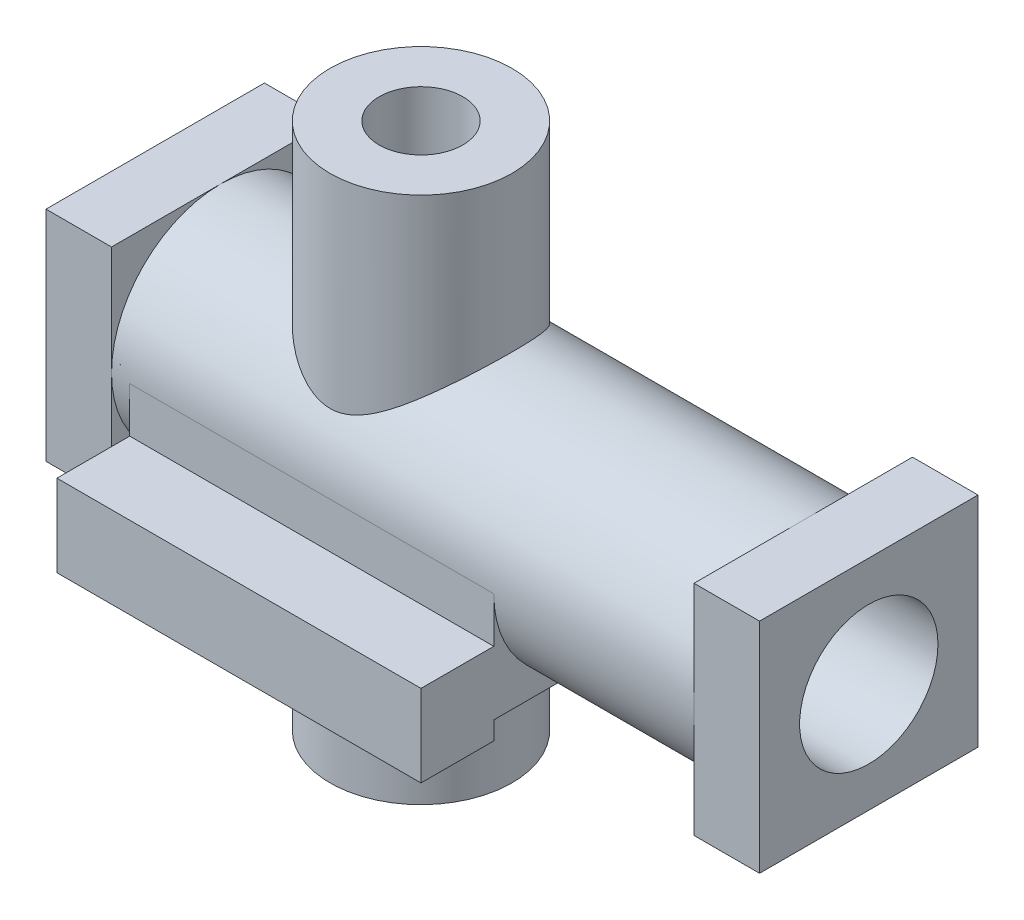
ISO-10303-21;
HEADER;
FILE_DESCRIPTION(('STEP AP214'),'2;1');
FILE_NAME('part.step','',(''),(''),'','','');
FILE_SCHEMA(('AUTOMOTIVE_DESIGN { 1 0 10303 214 1 1 1 1 }'));
ENDSEC;
DATA;
#1=APPLICATION_CONTEXT('core data for automotive mechanical design processes');
#2=APPLICATION_PROTOCOL_DEFINITION('international standard','automotive_design',2000,#1);
#3=PRODUCT_CONTEXT('',#1,'mechanical');
#4=PRODUCT('Part','Part','',(#3));
#5=PRODUCT_RELATED_PRODUCT_CATEGORY('part','',(#4));
#6=PRODUCT_DEFINITION_FORMATION('','',#4);
#7=PRODUCT_DEFINITION_CONTEXT('part definition',#1,'design');
#8=PRODUCT_DEFINITION('design','',#6,#7);
#9=PRODUCT_DEFINITION_SHAPE('','',#8);
#10=(LENGTH_UNIT() NAMED_UNIT(*) SI_UNIT(.MILLI.,.METRE.));
#11=(NAMED_UNIT(*) PLANE_ANGLE_UNIT() SI_UNIT($,.RADIAN.));
#12=(NAMED_UNIT(*) SI_UNIT($,.STERADIAN.) SOLID_ANGLE_UNIT());
#13=UNCERTAINTY_MEASURE_WITH_UNIT(LENGTH_MEASURE(1.E-05),#10,'distance_accuracy_value','');
#14=(GEOMETRIC_REPRESENTATION_CONTEXT(3) GLOBAL_UNCERTAINTY_ASSIGNED_CONTEXT((#13)) GLOBAL_UNIT_ASSIGNED_CONTEXT((#10,
#11,#12)) REPRESENTATION_CONTEXT('',''));
#15=CARTESIAN_POINT('',(0.,0.,0.));
#16=DIRECTION('',(0.,0.,1.));
#17=DIRECTION('',(1.,0.,0.));
#18=AXIS2_PLACEMENT_3D('',#15,#16,#17);
#19=CARTESIAN_POINT('',(304.8,0.,0.));
#20=DIRECTION('',(-1.,0.,0.));
#21=DIRECTION('',(0.,0.,1.));
#22=AXIS2_PLACEMENT_3D('',#19,#20,#21);
#23=CYLINDRICAL_SURFACE('',#22,76.2);
#24=CARTESIAN_POINT('',(0.,42.1211348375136,-63.5));
#25=CARTESIAN_POINT('',(-0.56113626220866,42.1211355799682,-63.4999996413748));
#26=CARTESIAN_POINT('',(-1.12227212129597,42.1323656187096,-63.4925556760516));
#27=CARTESIAN_POINT('',(-2.24327795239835,42.177105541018,-63.4628422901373));
#28=CARTESIAN_POINT('',(-2.80314778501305,42.2106177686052,-63.4405713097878));
#29=CARTESIAN_POINT('',(-4.47954352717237,42.3440363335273,-63.3516774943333));
#30=CARTESIAN_POINT('',(-5.59250801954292,42.4768241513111,-63.2629739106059));
#31=CARTESIAN_POINT('',(-7.8025086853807,42.8237412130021,-63.0286471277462));
#32=CARTESIAN_POINT('',(-8.89949021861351,43.0381019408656,-62.8828619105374));
#33=CARTESIAN_POINT('',(-11.0681713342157,43.5382661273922,-62.5376009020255));
#34=CARTESIAN_POINT('',(-12.1398707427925,43.8240700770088,-62.3381247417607));
#35=CARTESIAN_POINT('',(-14.6643769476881,44.5788383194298,-61.8017479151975));
#36=CARTESIAN_POINT('',(-16.1038462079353,45.075853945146,-61.4415514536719));
#37=CARTESIAN_POINT('',(-18.9233908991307,46.1582807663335,-60.6325762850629));
#38=CARTESIAN_POINT('',(-20.3034353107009,46.7437374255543,-60.1837519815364));
#39=CARTESIAN_POINT('',(-23.0076784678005,47.980137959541,-59.2027943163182));
#40=CARTESIAN_POINT('',(-24.3317213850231,48.6312494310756,-58.670445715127));
#41=CARTESIAN_POINT('',(-26.9221302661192,49.9776614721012,-57.5278446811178));
#42=CARTESIAN_POINT('',(-28.1884989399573,50.6729599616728,-56.9175959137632));
#43=CARTESIAN_POINT('',(-30.3222776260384,51.895021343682,-55.8016992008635));
#44=CARTESIAN_POINT('',(-31.2029857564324,52.4150859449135,-55.3139362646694));
#45=CARTESIAN_POINT('',(-32.936080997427,53.4649399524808,-54.2998407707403));
#46=CARTESIAN_POINT('',(-33.7884658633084,53.9947301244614,-53.7735051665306));
#47=CARTESIAN_POINT('',(-35.4654742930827,55.0596976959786,-52.6825504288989));
#48=CARTESIAN_POINT('',(-36.2900869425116,55.5948771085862,-52.1179165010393));
#49=CARTESIAN_POINT('',(-37.9112471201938,56.6664162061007,-50.9508082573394));
#50=CARTESIAN_POINT('',(-38.7077954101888,57.2027758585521,-50.3483349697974));
#51=CARTESIAN_POINT('',(-40.2718992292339,58.2725555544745,-49.1062166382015));
#52=CARTESIAN_POINT('',(-41.0394804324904,58.805977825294,-48.4666058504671));
#53=CARTESIAN_POINT('',(-42.5458879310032,59.8669921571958,-47.149743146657));
#54=CARTESIAN_POINT('',(-43.2847136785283,60.3945841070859,-46.4724905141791));
#55=CARTESIAN_POINT('',(-44.7324936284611,61.4405043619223,-45.0806154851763));
#56=CARTESIAN_POINT('',(-45.44145932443,61.9588361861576,-44.3660077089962));
#57=CARTESIAN_POINT('',(-46.8286856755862,62.9833090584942,-42.8992221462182));
#58=CARTESIAN_POINT('',(-47.5069450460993,63.4894495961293,-42.1470427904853));
#59=CARTESIAN_POINT('',(-49.2125396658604,64.7733871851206,-40.1614214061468));
#60=CARTESIAN_POINT('',(-50.2161856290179,65.5399299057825,-38.9000837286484));
#61=CARTESIAN_POINT('',(-52.1368835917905,67.0229260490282,-36.2853485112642));
#62=CARTESIAN_POINT('',(-53.0539389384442,67.7393814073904,-34.9319545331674));
#63=CARTESIAN_POINT('',(-54.7919747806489,69.1090789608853,-32.1371061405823));
#64=CARTESIAN_POINT('',(-55.6130799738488,69.7624030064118,-30.6957698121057));
#65=CARTESIAN_POINT('',(-57.1507608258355,70.9942799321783,-27.7278230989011));
#66=CARTESIAN_POINT('',(-57.8673554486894,71.5728463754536,-26.2012282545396));
#67=CARTESIAN_POINT('',(-59.0715384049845,72.5502273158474,-23.3404828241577));
#68=CARTESIAN_POINT('',(-59.5773010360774,72.9628264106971,-22.018672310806));
#69=CARTESIAN_POINT('',(-60.5040493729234,73.7214969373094,-19.3270564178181));
#70=CARTESIAN_POINT('',(-60.9250440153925,74.0675753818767,-17.9572561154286));
#71=CARTESIAN_POINT('',(-61.6763260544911,74.6867722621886,-15.1773791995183));
#72=CARTESIAN_POINT('',(-62.0066492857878,74.9599195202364,-13.7673187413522));
#73=CARTESIAN_POINT('',(-62.5717156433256,75.4280088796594,-10.9152862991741));
#74=CARTESIAN_POINT('',(-62.8064576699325,75.6229500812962,-9.47331394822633));
#75=CARTESIAN_POINT('',(-63.1771821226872,75.9311244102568,-6.56172709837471));
#76=CARTESIAN_POINT('',(-63.3127414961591,76.0440075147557,-5.09202130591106));
#77=CARTESIAN_POINT('',(-63.4810273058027,76.1841758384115,-2.14263093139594));
#78=CARTESIAN_POINT('',(-63.5137535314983,76.2114608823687,-0.662946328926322));
#79=CARTESIAN_POINT('',(-63.4757705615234,76.1798093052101,2.29413321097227));
#80=CARTESIAN_POINT('',(-63.4050629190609,76.1208739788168,3.77152818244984));
#81=CARTESIAN_POINT('',(-63.1615093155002,75.9181249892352,6.71192510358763));
#82=CARTESIAN_POINT('',(-62.9886668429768,75.7743142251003,8.17492754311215));
#83=CARTESIAN_POINT('',(-62.5588987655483,75.4174552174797,10.9775768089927));
#84=CARTESIAN_POINT('',(-62.3084127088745,75.2097162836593,12.318900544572));
#85=CARTESIAN_POINT('',(-61.72489496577,74.7270084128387,14.9709984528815));
#86=CARTESIAN_POINT('',(-61.3918678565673,74.4520432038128,16.2817743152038));
#87=CARTESIAN_POINT('',(-60.6476359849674,73.8395630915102,18.8659070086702));
#88=CARTESIAN_POINT('',(-60.2364292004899,73.5020465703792,20.1392628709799));
#89=CARTESIAN_POINT('',(-59.3406715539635,72.769765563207,22.6429410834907));
#90=CARTESIAN_POINT('',(-58.85611610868,72.3749974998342,23.8732607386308));
#91=CARTESIAN_POINT('',(-57.7742938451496,71.4979041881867,26.3896489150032));
#92=CARTESIAN_POINT('',(-57.170932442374,71.0109786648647,27.6714901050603));
#93=CARTESIAN_POINT('',(-55.8899617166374,69.9837935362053,30.1751538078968));
#94=CARTESIAN_POINT('',(-55.2123500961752,69.4435322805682,31.3969744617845));
#95=CARTESIAN_POINT('',(-53.7882547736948,68.316737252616,33.7786969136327));
#96=CARTESIAN_POINT('',(-53.0417229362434,67.7301711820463,34.9385545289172));
#97=CARTESIAN_POINT('',(-51.4853366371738,66.5183527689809,37.1939195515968));
#98=CARTESIAN_POINT('',(-50.6754753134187,65.8930962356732,38.28941996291));
#99=CARTESIAN_POINT('',(-49.216981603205,64.7791758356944,40.1364866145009));
#100=CARTESIAN_POINT('',(-48.5816862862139,64.2976353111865,40.9029755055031));
#101=CARTESIAN_POINT('',(-47.2806293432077,63.3203240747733,42.400184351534));
#102=CARTESIAN_POINT('',(-46.6148681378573,62.8245535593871,43.1309048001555));
#103=CARTESIAN_POINT('',(-45.2538732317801,61.8214477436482,44.5568044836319));
#104=CARTESIAN_POINT('',(-44.5586264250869,61.3141073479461,45.2519676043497));
#105=CARTESIAN_POINT('',(-43.1399745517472,60.2910101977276,46.6063765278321));
#106=CARTESIAN_POINT('',(-42.4165701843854,59.7752536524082,47.2656232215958));
#107=CARTESIAN_POINT('',(-40.9411611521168,58.7374940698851,48.5492432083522));
#108=CARTESIAN_POINT('',(-40.1891123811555,58.2154823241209,49.1735587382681));
#109=CARTESIAN_POINT('',(-38.6579872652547,57.169200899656,50.3861463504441));
#110=CARTESIAN_POINT('',(-37.8789103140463,56.6449311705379,50.974417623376));
#111=CARTESIAN_POINT('',(-36.2942239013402,55.5977248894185,52.1146029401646));
#112=CARTESIAN_POINT('',(-35.4886235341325,55.07478794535,52.6665292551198));
#113=CARTESIAN_POINT('',(-33.8506661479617,54.0338601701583,53.7339543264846));
#114=CARTESIAN_POINT('',(-33.0183106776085,53.5158690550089,54.2494551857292));
#115=CARTESIAN_POINT('',(-30.9306733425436,52.2486448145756,55.4762876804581));
#116=CARTESIAN_POINT('',(-29.659677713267,51.5045788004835,56.1664335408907));
#117=CARTESIAN_POINT('',(-27.0573388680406,50.0512185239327,57.4653403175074));
#118=CARTESIAN_POINT('',(-25.7259918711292,49.341926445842,58.0740961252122));
#119=CARTESIAN_POINT('',(-23.0037103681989,47.9789031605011,59.2051268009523));
#120=CARTESIAN_POINT('',(-21.6129218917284,47.3250463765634,59.7275998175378));
#121=CARTESIAN_POINT('',(-18.7672926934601,46.095089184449,60.6818610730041));
#122=CARTESIAN_POINT('',(-17.3124830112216,45.518951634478,61.1136926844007));
#123=CARTESIAN_POINT('',(-14.824173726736,44.6437809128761,61.7540631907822));
#124=CARTESIAN_POINT('',(-13.8078149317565,44.3156182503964,61.9895158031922));
#125=CARTESIAN_POINT('',(-11.748189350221,43.717724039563,62.4126169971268));
#126=CARTESIAN_POINT('',(-10.7049261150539,43.4479848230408,62.6002718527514));
#127=CARTESIAN_POINT('',(-8.59722441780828,42.9773182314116,62.924335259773));
#128=CARTESIAN_POINT('',(-7.53283269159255,42.776253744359,63.0608459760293));
#129=CARTESIAN_POINT('',(-5.38677271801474,42.450949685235,63.2802945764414));
#130=CARTESIAN_POINT('',(-4.30510504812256,42.3267075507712,63.3632342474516));
#131=CARTESIAN_POINT('',(-2.12452165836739,42.1605698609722,63.4739052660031));
#132=CARTESIAN_POINT('',(-1.0255375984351,42.1192863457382,63.5012262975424));
#133=CARTESIAN_POINT('',(1.1721799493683,42.1231109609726,63.4986890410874));
#134=CARTESIAN_POINT('',(2.27091344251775,42.1682170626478,63.4688320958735));
#135=CARTESIAN_POINT('',(4.45988184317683,42.3425136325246,63.3526818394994));
#136=CARTESIAN_POINT('',(5.55010527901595,42.4718026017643,63.2663224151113));
#137=CARTESIAN_POINT('',(7.71269301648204,42.8081001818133,63.0392522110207));
#138=CARTESIAN_POINT('',(8.7850543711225,43.0151214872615,62.8985325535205));
#139=CARTESIAN_POINT('',(11.1734035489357,43.5587332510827,62.5236867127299));
#140=CARTESIAN_POINT('',(12.4826500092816,43.9148315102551,62.2749556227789));
#141=CARTESIAN_POINT('',(15.05718840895,44.7147498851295,61.7030960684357));
#142=CARTESIAN_POINT('',(16.3224655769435,45.1585991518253,61.3799428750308));
#143=CARTESIAN_POINT('',(18.8099460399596,46.1159664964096,60.6639577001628));
#144=CARTESIAN_POINT('',(20.0320219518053,46.6296719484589,60.2709374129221));
#145=CARTESIAN_POINT('',(22.4297401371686,47.708873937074,59.4203269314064));
#146=CARTESIAN_POINT('',(23.6053807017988,48.2743723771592,58.9627343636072));
#147=CARTESIAN_POINT('',(25.6631638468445,49.3171399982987,58.0914552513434));
#148=CARTESIAN_POINT('',(26.554008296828,49.7871972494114,57.6895216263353));
#149=CARTESIAN_POINT('',(28.308744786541,50.7447960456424,56.849023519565));
#150=CARTESIAN_POINT('',(29.1726338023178,51.2323395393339,56.4104549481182));
#151=CARTESIAN_POINT('',(30.8743416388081,52.2200613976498,55.4973675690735));
#152=CARTESIAN_POINT('',(31.7121489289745,52.7202451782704,55.0228331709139));
#153=CARTESIAN_POINT('',(33.3617576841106,53.7286783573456,54.0385563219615));
#154=CARTESIAN_POINT('',(34.1735600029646,54.2369274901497,53.5288150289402));
#155=CARTESIAN_POINT('',(35.7723881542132,55.2582580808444,52.4738469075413));
#156=CARTESIAN_POINT('',(36.5593836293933,55.7713445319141,51.9285789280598));
#157=CARTESIAN_POINT('',(38.1076195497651,56.7982844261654,50.8032984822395));
#158=CARTESIAN_POINT('',(38.8688598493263,57.3121378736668,50.223285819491));
#159=CARTESIAN_POINT('',(40.3652079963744,58.3373217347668,49.0287292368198));
#160=CARTESIAN_POINT('',(41.1003208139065,58.8486526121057,48.4141919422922));
#161=CARTESIAN_POINT('',(42.5440863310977,59.8659077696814,47.1505146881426));
#162=CARTESIAN_POINT('',(43.2527389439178,60.3718320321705,46.5013746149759));
#163=CARTESIAN_POINT('',(44.6607083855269,61.3883177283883,45.1513743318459));
#164=CARTESIAN_POINT('',(45.359317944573,61.89866451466,44.4496139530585));
#165=CARTESIAN_POINT('',(46.7268570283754,62.9076799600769,43.0097273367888));
#166=CARTESIAN_POINT('',(47.3957871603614,63.4063488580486,42.2716018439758));
#167=CARTESIAN_POINT('',(48.7028035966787,64.3891876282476,40.7588796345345));
#168=CARTESIAN_POINT('',(49.3408830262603,64.8733542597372,39.9842748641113));
#169=CARTESIAN_POINT('',(50.5844612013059,65.8241377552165,38.3989221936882));
#170=CARTESIAN_POINT('',(51.1899595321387,66.29075439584,37.5881738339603));
#171=CARTESIAN_POINT('',(52.3648962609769,67.2021973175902,35.9331961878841));
#172=CARTESIAN_POINT('',(52.9344302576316,67.647080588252,35.0890662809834));
#173=CARTESIAN_POINT('',(54.0371830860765,68.5134352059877,33.3658381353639));
#174=CARTESIAN_POINT('',(54.5704040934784,68.9349079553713,32.4867419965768));
#175=CARTESIAN_POINT('',(55.597999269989,69.7512020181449,30.6949238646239));
#176=CARTESIAN_POINT('',(56.0923974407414,70.1460397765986,29.7822231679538));
#177=CARTESIAN_POINT('',(57.0403834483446,70.9063834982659,27.9237027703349));
#178=CARTESIAN_POINT('',(57.4939620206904,71.2718828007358,26.9778756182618));
#179=CARTESIAN_POINT('',(58.5022831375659,72.0873916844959,24.7328141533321));
#180=CARTESIAN_POINT('',(59.0400612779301,72.5247324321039,23.4212668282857));
#181=CARTESIAN_POINT('',(60.0318366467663,73.3343669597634,20.7475357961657));
#182=CARTESIAN_POINT('',(60.4858567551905,73.7066785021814,19.3853660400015));
#183=CARTESIAN_POINT('',(61.0994579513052,74.2113222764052,17.3097420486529));
#184=CARTESIAN_POINT('',(61.2927365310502,74.3705521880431,16.6125484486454));
#185=CARTESIAN_POINT('',(61.6561769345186,74.6703660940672,15.2082730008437));
#186=CARTESIAN_POINT('',(61.8263425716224,74.8109531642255,14.5011928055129));
#187=CARTESIAN_POINT('',(62.1429349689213,75.0728077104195,13.0781151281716));
#188=CARTESIAN_POINT('',(62.2893591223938,75.1940730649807,12.3621166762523));
#189=CARTESIAN_POINT('',(62.5578631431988,75.4166466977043,10.9224510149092));
#190=CARTESIAN_POINT('',(62.6799419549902,75.5179541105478,10.1987834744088));
#191=CARTESIAN_POINT('',(62.8997576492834,75.7005002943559,8.7416246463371));
#192=CARTESIAN_POINT('',(62.9973745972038,75.7816401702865,8.00810284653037));
#193=CARTESIAN_POINT('',(63.1670769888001,75.9227725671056,6.53600785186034));
#194=CARTESIAN_POINT('',(63.2391598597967,75.9827629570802,5.79743415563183));
#195=CARTESIAN_POINT('',(63.3574477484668,76.0812402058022,4.3168597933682));
#196=CARTESIAN_POINT('',(63.4036553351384,76.1197291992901,3.57485947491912));
#197=CARTESIAN_POINT('',(63.4699939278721,76.1749945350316,2.08880741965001));
#198=CARTESIAN_POINT('',(63.4901222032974,76.1917686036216,1.34475547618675));
#199=CARTESIAN_POINT('',(63.5041979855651,76.2034982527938,-0.143656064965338));
#200=CARTESIAN_POINT('',(63.4981494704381,76.1984571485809,-0.888015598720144));
#201=CARTESIAN_POINT('',(63.459907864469,76.1665923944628,-2.37567521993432));
#202=CARTESIAN_POINT('',(63.4277118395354,76.1397662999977,-3.11897517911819));
#203=CARTESIAN_POINT('',(63.3373240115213,76.0644856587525,-4.60279182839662));
#204=CARTESIAN_POINT('',(63.2791361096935,76.0160343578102,-5.34330891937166));
#205=CARTESIAN_POINT('',(63.13703980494,75.8977883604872,-6.82018018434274));
#206=CARTESIAN_POINT('',(63.0531289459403,75.8279916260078,-7.55653395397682));
#207=CARTESIAN_POINT('',(62.7774508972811,75.5988636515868,-9.6499413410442));
#208=CARTESIAN_POINT('',(62.5547555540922,75.4139601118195,-11.0003324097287));
#209=CARTESIAN_POINT('',(62.0254693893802,74.9755090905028,-13.6728828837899));
#210=CARTESIAN_POINT('',(61.7188835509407,74.7219656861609,-14.9950439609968));
#211=CARTESIAN_POINT('',(61.0259499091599,74.150644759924,-17.6041256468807));
#212=CARTESIAN_POINT('',(60.6395984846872,73.8328643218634,-18.8910446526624));
#213=CARTESIAN_POINT('',(59.7918668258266,73.1382139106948,-21.4234956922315));
#214=CARTESIAN_POINT('',(59.3304820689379,72.7613403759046,-22.6690252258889));
#215=CARTESIAN_POINT('',(58.3017076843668,71.9248428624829,-25.2024387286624));
#216=CARTESIAN_POINT('',(57.7290611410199,71.4612027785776,-26.4868581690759));
#217=CARTESIAN_POINT('',(56.5093515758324,70.4795416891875,-28.9981403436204));
#218=CARTESIAN_POINT('',(55.8622869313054,69.9615194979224,-30.2250018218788));
#219=CARTESIAN_POINT('',(54.4991722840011,68.8779982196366,-32.6188389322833));
#220=CARTESIAN_POINT('',(53.7830827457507,68.31247194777,-33.7857796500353));
#221=CARTESIAN_POINT('',(52.2874041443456,67.1412404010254,-36.0572716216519));
#222=CARTESIAN_POINT('',(51.5078078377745,66.5355305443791,-37.1618157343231));
#223=CARTESIAN_POINT('',(50.1014907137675,65.4538294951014,-39.0265942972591));
#224=CARTESIAN_POINT('',(49.4881068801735,64.985339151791,-39.8013314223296));
#225=CARTESIAN_POINT('',(48.2308542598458,64.0330911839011,-41.3158963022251));
#226=CARTESIAN_POINT('',(47.5869858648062,63.549333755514,-42.0557245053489));
#227=CARTESIAN_POINT('',(46.2698554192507,62.5691290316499,-43.5006507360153));
#228=CARTESIAN_POINT('',(45.5965807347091,62.0726763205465,-44.2057335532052));
#229=CARTESIAN_POINT('',(44.2220240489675,61.0700935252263,-45.5807812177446));
#230=CARTESIAN_POINT('',(43.520742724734,60.563963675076,-46.2507469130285));
#231=CARTESIAN_POINT('',(42.0896593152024,59.543908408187,-47.5568171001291));
#232=CARTESIAN_POINT('',(41.3598053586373,59.0299699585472,-48.1928545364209));
#233=CARTESIAN_POINT('',(39.8734339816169,57.9982282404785,-49.4296880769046));
#234=CARTESIAN_POINT('',(39.1169160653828,57.4804249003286,-50.0304835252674));
#235=CARTESIAN_POINT('',(37.5778134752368,56.4442938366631,-51.1965803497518));
#236=CARTESIAN_POINT('',(36.7952366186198,55.9259663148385,-51.7618922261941));
#237=CARTESIAN_POINT('',(35.2039146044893,54.8920727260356,-52.8570459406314));
#238=CARTESIAN_POINT('',(34.3951706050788,54.3765065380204,-53.3868893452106));
#239=CARTESIAN_POINT('',(32.9299475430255,53.4632446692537,-54.2995664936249));
#240=CARTESIAN_POINT('',(32.2785645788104,53.0642777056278,-54.6893287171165));
#241=CARTESIAN_POINT('',(30.9594798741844,52.2723743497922,-55.4467223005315));
#242=CARTESIAN_POINT('',(30.2917785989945,51.8794377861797,-55.8143542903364));
#243=CARTESIAN_POINT('',(28.9396562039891,51.1017394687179,-56.5272547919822));
#244=CARTESIAN_POINT('',(28.2552318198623,50.7169793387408,-56.8725188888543));
#245=CARTESIAN_POINT('',(26.8695305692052,49.9582382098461,-57.54015773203));
#246=CARTESIAN_POINT('',(26.1682552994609,49.5842561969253,-57.8625346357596));
#247=CARTESIAN_POINT('',(24.7499287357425,48.850602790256,-58.4832368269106));
#248=CARTESIAN_POINT('',(24.0329137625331,48.490902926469,-58.78161132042));
#249=CARTESIAN_POINT('',(22.5813216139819,47.7881027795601,-59.3543826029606));
#250=CARTESIAN_POINT('',(21.8467439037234,47.445003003,-59.6287786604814));
#251=CARTESIAN_POINT('',(20.3601456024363,46.779099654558,-60.1525991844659));
#252=CARTESIAN_POINT('',(19.6081341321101,46.4562857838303,-60.4020363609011));
#253=CARTESIAN_POINT('',(18.0862652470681,45.8347091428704,-60.8750523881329));
#254=CARTESIAN_POINT('',(17.3164083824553,45.535945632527,-61.098632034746));
#255=CARTESIAN_POINT('',(15.5094740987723,44.8755845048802,-61.5860370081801));
#256=CARTESIAN_POINT('',(14.4657668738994,44.5245003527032,-61.8398247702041));
#257=CARTESIAN_POINT('',(12.3490482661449,43.8824807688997,-62.2970581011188));
#258=CARTESIAN_POINT('',(11.2760359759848,43.5915472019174,-62.5005021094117));
#259=CARTESIAN_POINT('',(9.10760965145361,43.0817069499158,-62.8530260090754));
#260=CARTESIAN_POINT('',(8.01227989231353,42.8625689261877,-63.0022806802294));
#261=CARTESIAN_POINT('',(6.35540080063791,42.5944059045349,-63.1836048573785));
#262=CARTESIAN_POINT('',(5.80089593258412,42.5151178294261,-63.2369474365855));
#263=CARTESIAN_POINT('',(4.68810187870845,42.3776325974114,-63.3291654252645));
#264=CARTESIAN_POINT('',(4.12981312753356,42.3194330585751,-63.3680424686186));
#265=CARTESIAN_POINT('',(2.97723416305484,42.2220893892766,-63.4329472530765));
#266=CARTESIAN_POINT('',(2.38277925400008,42.1842858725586,-63.4580723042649));
#267=CARTESIAN_POINT('',(1.1922162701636,42.1338058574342,-63.4916004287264));
#268=CARTESIAN_POINT('',(0.596107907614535,42.1211340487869,-63.5000003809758));
#269=CARTESIAN_POINT('',(0.,42.1211348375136,-63.5));
#270=B_SPLINE_CURVE_WITH_KNOTS('',3,(#24,#25,#26,#27,#28,#29,#30,#31,#32,#33,#34,#35,#36,#37,
#38,#39,#40,#41,#42,#43,#44,#45,#46,#47,#48,#49,#50,#51,#52,#53,#54,#55,#56,#57,#58,#59,#60,#61,
#62,#63,#64,#65,#66,#67,#68,#69,#70,#71,#72,#73,#74,#75,#76,#77,#78,#79,#80,#81,#82,#83,#84,#85,
#86,#87,#88,#89,#90,#91,#92,#93,#94,#95,#96,#97,#98,#99,#100,#101,#102,#103,#104,#105,#106,#107,
#108,#109,#110,#111,#112,#113,#114,#115,#116,#117,#118,#119,#120,#121,#122,#123,#124,#125,#126,
#127,#128,#129,#130,#131,#132,#133,#134,#135,#136,#137,#138,#139,#140,#141,#142,#143,#144,#145,
#146,#147,#148,#149,#150,#151,#152,#153,#154,#155,#156,#157,#158,#159,#160,#161,#162,#163,#164,
#165,#166,#167,#168,#169,#170,#171,#172,#173,#174,#175,#176,#177,#178,#179,#180,#181,#182,#183,
#184,#185,#186,#187,#188,#189,#190,#191,#192,#193,#194,#195,#196,#197,#198,#199,#200,#201,#202,
#203,#204,#205,#206,#207,#208,#209,#210,#211,#212,#213,#214,#215,#216,#217,#218,#219,#220,#221,
#222,#223,#224,#225,#226,#227,#228,#229,#230,#231,#232,#233,#234,#235,#236,#237,#238,#239,#240,
#241,#242,#243,#244,#245,#246,#247,#248,#249,#250,#251,#252,#253,#254,#255,#256,#257,#258,#259,
#260,#261,#262,#263,#264,#265,#266,#267,#268,#269),.UNSPECIFIED.,.T.,.F.,(4,2,2,2,2,2,2,2,2,2,2,
2,2,2,2,2,2,2,2,2,2,2,2,2,2,2,2,2,2,2,2,2,2,2,2,2,2,2,2,2,2,2,2,2,2,2,2,2,2,2,2,2,2,2,2,2,2,2,2,
2,2,2,2,2,2,2,2,2,2,2,2,2,2,2,2,2,2,2,2,2,2,2,2,2,2,2,2,2,2,2,2,2,2,2,2,2,2,2,2,2,2,2,2,2,2,2,2,
2,2,2,2,2,2,2,2,2,2,2,2,2,2,2,4),(0.,1.68322869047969,3.36663447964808,6.73448479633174,
10.1119643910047,13.4894671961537,18.1764604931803,22.8658714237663,27.5675715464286,
32.2690505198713,35.6675020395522,39.0662222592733,42.466262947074,45.8662112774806,
49.2630717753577,52.6599969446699,56.0556024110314,59.4513498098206,64.8008995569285,
70.1502424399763,75.4925540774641,80.8338951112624,85.252084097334,89.6698070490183,
94.0857815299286,98.5018068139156,102.936560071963,107.371322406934,111.806018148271,
116.240562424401,120.376748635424,124.512705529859,128.648769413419,132.785091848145,
137.275067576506,141.765182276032,146.258457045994,150.752219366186,154.068839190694,
157.385413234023,160.703477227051,164.021458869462,167.344774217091,170.668164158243,
173.990426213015,177.312496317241,182.188454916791,187.064719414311,191.929624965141,
196.792197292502,200.070710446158,203.348793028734,206.620291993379,209.891681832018,
213.187119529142,216.482479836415,219.781702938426,223.081465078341,227.21316725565,
231.346244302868,235.4906345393,239.635177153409,242.887545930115,246.140278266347,
249.394428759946,252.648472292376,255.906354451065,259.164255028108,262.421532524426,
265.678820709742,269.019770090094,272.360651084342,275.702273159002,279.043937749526,
282.376309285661,285.708480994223,289.038576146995,292.369425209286,296.815311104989,
301.259980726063,303.481842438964,305.703337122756,307.925075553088,310.146910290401,
312.379434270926,314.612183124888,316.844710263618,319.077471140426,321.309892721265,
323.542564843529,325.774901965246,328.00745230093,332.145568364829,336.283438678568,
340.421496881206,344.559804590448,348.997792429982,353.43587705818,357.876518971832,
362.317668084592,365.597397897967,368.877085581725,372.158196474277,375.439228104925,
378.72652078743,382.013874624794,385.300251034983,388.586482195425,391.158698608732,
393.730841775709,396.303491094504,398.875897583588,401.442888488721,404.009957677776,
406.575712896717,409.141389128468,412.528621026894,415.915957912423,419.292270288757,
420.979811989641,422.667163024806,424.454961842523,426.243094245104),.UNSPECIFIED.);
#271=CARTESIAN_POINT('',(0.,42.1211348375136,-63.5));
#272=VERTEX_POINT('',#271);
#273=EDGE_CURVE('E379',#272,#272,#270,.T.);
#274=ORIENTED_EDGE('',*,*,#273,.F.);
#275=EDGE_LOOP('',(#274));
#276=FACE_BOUND('',#275,.T.);
#277=CARTESIAN_POINT('',(266.7,0.,0.));
#278=DIRECTION('',(-1.,0.,0.));
#279=DIRECTION('',(0.,0.,1.));
#280=AXIS2_PLACEMENT_3D('',#277,#278,#279);
#281=CIRCLE('',#280,76.2);
#282=CARTESIAN_POINT('',(266.7,-76.2,0.));
#283=VERTEX_POINT('',#282);
#284=CARTESIAN_POINT('',(266.7,0.,76.2));
#285=VERTEX_POINT('',#284);
#286=EDGE_CURVE('E389',#283,#285,#281,.T.);
#287=ORIENTED_EDGE('',*,*,#286,.T.);
#288=CARTESIAN_POINT('',(266.7,76.2,0.));
#289=VERTEX_POINT('',#288);
#290=EDGE_CURVE('E489',#285,#289,#281,.T.);
#291=ORIENTED_EDGE('',*,*,#290,.T.);
#292=CARTESIAN_POINT('',(266.7,0.,-76.2));
#293=VERTEX_POINT('',#292);
#294=EDGE_CURVE('E495',#289,#293,#281,.T.);
#295=ORIENTED_EDGE('',*,*,#294,.T.);
#296=EDGE_CURVE('E537',#293,#283,#281,.T.);
#297=ORIENTED_EDGE('',*,*,#296,.T.);
#298=EDGE_LOOP('',(#287,#291,#295,#297));
#299=FACE_BOUND('',#298,.T.);
#300=CARTESIAN_POINT('',(-139.7,0.,0.));
#301=DIRECTION('',(1.,0.,0.));
#302=DIRECTION('',(0.,0.,-1.));
#303=AXIS2_PLACEMENT_3D('',#300,#301,#302);
#304=CIRCLE('',#303,76.2);
#305=CARTESIAN_POINT('',(-139.7,-76.2,0.));
#306=VERTEX_POINT('',#305);
#307=CARTESIAN_POINT('',(-139.7,0.,-76.2));
#308=VERTEX_POINT('',#307);
#309=EDGE_CURVE('E486',#306,#308,#304,.T.);
#310=ORIENTED_EDGE('',*,*,#309,.T.);
#311=CARTESIAN_POINT('',(-139.7,76.2,0.));
#312=VERTEX_POINT('',#311);
#313=EDGE_CURVE('E485',#308,#312,#304,.T.);
#314=ORIENTED_EDGE('',*,*,#313,.T.);
#315=CARTESIAN_POINT('',(-139.7,0.,76.2));
#316=VERTEX_POINT('',#315);
#317=EDGE_CURVE('E493',#312,#316,#304,.T.);
#318=ORIENTED_EDGE('',*,*,#317,.T.);
#319=EDGE_CURVE('E488',#316,#306,#304,.T.);
#320=ORIENTED_EDGE('',*,*,#319,.T.);
#321=EDGE_LOOP('',(#310,#314,#318,#320));
#322=FACE_BOUND('',#321,.T.);
#323=CARTESIAN_POINT('',(-127.,0.,0.));
#324=DIRECTION('',(1.,0.,0.));
#325=DIRECTION('',(0.,0.,-1.));
#326=AXIS2_PLACEMENT_3D('',#323,#324,#325);
#327=CIRCLE('',#326,76.2);
#328=CARTESIAN_POINT('',(-127.,0.,76.2));
#329=VERTEX_POINT('',#328);
#330=CARTESIAN_POINT('',(-127.,-76.2,0.));
#331=VERTEX_POINT('',#330);
#332=EDGE_CURVE('E51',#329,#331,#327,.T.);
#333=ORIENTED_EDGE('',*,*,#332,.F.);
#334=DIRECTION('',(-1.,0.,0.));
#335=VECTOR('',#334,1.);
#336=CARTESIAN_POINT('',(304.8,0.,76.2));
#337=LINE('',#336,#335);
#338=CARTESIAN_POINT('',(127.,0.,76.2));
#339=VERTEX_POINT('',#338);
#340=EDGE_CURVE('E224',#329,#339,#337,.F.);
#341=ORIENTED_EDGE('',*,*,#340,.T.);
#342=CARTESIAN_POINT('',(127.,0.,0.));
#343=DIRECTION('',(1.,0.,0.));
#344=DIRECTION('',(0.,0.,-1.));
#345=AXIS2_PLACEMENT_3D('',#342,#343,#344);
#346=CIRCLE('',#345,76.2);
#347=CARTESIAN_POINT('',(127.,-76.2,0.));
#348=VERTEX_POINT('',#347);
#349=EDGE_CURVE('E11',#339,#348,#346,.T.);
#350=ORIENTED_EDGE('',*,*,#349,.T.);
#351=CARTESIAN_POINT('',(127.,0.,-76.2));
#352=VERTEX_POINT('',#351);
#353=EDGE_CURVE('E43',#348,#352,#346,.T.);
#354=ORIENTED_EDGE('',*,*,#353,.T.);
#355=DIRECTION('',(-1.,0.,0.));
#356=VECTOR('',#355,1.);
#357=CARTESIAN_POINT('',(304.8,0.,-76.2));
#358=LINE('',#357,#356);
#359=CARTESIAN_POINT('',(-127.,0.,-76.2));
#360=VERTEX_POINT('',#359);
#361=EDGE_CURVE('E229',#360,#352,#358,.F.);
#362=ORIENTED_EDGE('',*,*,#361,.F.);
#363=EDGE_CURVE('E481',#331,#360,#327,.T.);
#364=ORIENTED_EDGE('',*,*,#363,.F.);
#365=EDGE_LOOP('',(#333,#341,#350,#354,#362,#364));
#366=FACE_BOUND('',#365,.T.);
#367=ADVANCED_FACE('F30',(#276,#299,#322,#366),#23,.T.);
#368=CARTESIAN_POINT('',(-127.,-31.75,-127.));
#369=DIRECTION('',(0.,1.,0.));
#370=DIRECTION('',(0.,0.,1.));
#371=AXIS2_PLACEMENT_3D('',#368,#369,#370);
#372=PLANE('',#371);
#373=DIRECTION('',(0.,0.,1.));
#374=VECTOR('',#373,1.);
#375=CARTESIAN_POINT('',(-127.,-31.75,-127.));
#376=LINE('',#375,#374);
#377=CARTESIAN_POINT('',(-127.,-31.75,-127.));
#378=VERTEX_POINT('',#377);
#379=CARTESIAN_POINT('',(-127.,-31.75,-76.2));
#380=VERTEX_POINT('',#379);
#381=EDGE_CURVE('E214',#378,#380,#376,.T.);
#382=ORIENTED_EDGE('',*,*,#381,.T.);
#383=DIRECTION('',(-1.,0.,0.));
#384=VECTOR('',#383,1.);
#385=CARTESIAN_POINT('',(127.,-31.75,-76.2));
#386=LINE('',#385,#384);
#387=CARTESIAN_POINT('',(127.,-31.75,-76.2));
#388=VERTEX_POINT('',#387);
#389=EDGE_CURVE('E217',#388,#380,#386,.T.);
#390=ORIENTED_EDGE('',*,*,#389,.F.);
#391=DIRECTION('',(0.,0.,-1.));
#392=VECTOR('',#391,1.);
#393=CARTESIAN_POINT('',(127.,-31.75,-65.0099838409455));
#394=LINE('',#393,#392);
#395=CARTESIAN_POINT('',(127.,-31.75,-127.));
#396=VERTEX_POINT('',#395);
#397=EDGE_CURVE('E202',#388,#396,#394,.T.);
#398=ORIENTED_EDGE('',*,*,#397,.T.);
#399=DIRECTION('',(-1.,0.,0.));
#400=VECTOR('',#399,1.);
#401=CARTESIAN_POINT('',(127.,-31.75,-127.));
#402=LINE('',#401,#400);
#403=EDGE_CURVE('E258',#396,#378,#402,.T.);
#404=ORIENTED_EDGE('',*,*,#403,.T.);
#405=EDGE_LOOP('',(#382,#390,#398,#404));
#406=FACE_BOUND('',#405,.T.);
#407=ADVANCED_FACE('F218',(#406),#372,.T.);
#408=CARTESIAN_POINT('',(0.,177.8,0.));
#409=DIRECTION('',(0.,-1.,0.));
#410=DIRECTION('',(0.,0.,-1.));
#411=AXIS2_PLACEMENT_3D('',#408,#409,#410);
#412=CYLINDRICAL_SURFACE('',#411,63.5);
#413=ORIENTED_EDGE('',*,*,#273,.T.);
#414=EDGE_LOOP('',(#413));
#415=FACE_BOUND('',#414,.T.);
#416=CARTESIAN_POINT('',(0.,184.15,0.));
#417=DIRECTION('',(0.,1.,0.));
#418=DIRECTION('',(0.,0.,1.));
#419=AXIS2_PLACEMENT_3D('',#416,#417,#418);
#420=CIRCLE('',#419,63.5);
#421=CARTESIAN_POINT('',(0.,184.15,63.5));
#422=VERTEX_POINT('',#421);
#423=EDGE_CURVE('E306',#422,#422,#420,.T.);
#424=ORIENTED_EDGE('',*,*,#423,.F.);
#425=EDGE_LOOP('',(#424));
#426=FACE_BOUND('',#425,.T.);
#427=ADVANCED_FACE('F391',(#415,#426),#412,.T.);
#428=CARTESIAN_POINT('',(266.7,-76.2,76.2000000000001));
#429=DIRECTION('',(-1.,0.,0.));
#430=DIRECTION('',(0.,0.,1.));
#431=AXIS2_PLACEMENT_3D('',#428,#429,#430);
#432=PLANE('',#431);
#433=ORIENTED_EDGE('',*,*,#290,.F.);
#434=DIRECTION('',(0.,-1.,0.));
#435=VECTOR('',#434,1.);
#436=CARTESIAN_POINT('',(266.7,76.2,76.2));
#437=LINE('',#436,#435);
#438=CARTESIAN_POINT('',(266.7,76.2,76.2));
#439=VERTEX_POINT('',#438);
#440=EDGE_CURVE('E362',#439,#285,#437,.T.);
#441=ORIENTED_EDGE('',*,*,#440,.F.);
#442=DIRECTION('',(0.,0.,-1.));
#443=VECTOR('',#442,1.);
#444=CARTESIAN_POINT('',(266.7,76.2,76.2));
#445=LINE('',#444,#443);
#446=EDGE_CURVE('E373',#439,#289,#445,.T.);
#447=ORIENTED_EDGE('',*,*,#446,.T.);
#448=EDGE_LOOP('',(#433,#441,#447));
#449=FACE_BOUND('',#448,.T.);
#450=ADVANCED_FACE('F395',(#449),#432,.T.);
#451=ORIENTED_EDGE('',*,*,#294,.F.);
#452=CARTESIAN_POINT('',(266.7,76.2,-76.2));
#453=VERTEX_POINT('',#452);
#454=EDGE_CURVE('E372',#289,#453,#445,.T.);
#455=ORIENTED_EDGE('',*,*,#454,.T.);
#456=DIRECTION('',(0.,1.,0.));
#457=VECTOR('',#456,1.);
#458=CARTESIAN_POINT('',(266.7,-76.2,-76.2));
#459=LINE('',#458,#457);
#460=EDGE_CURVE('E368',#293,#453,#459,.T.);
#461=ORIENTED_EDGE('',*,*,#460,.F.);
#462=EDGE_LOOP('',(#451,#455,#461));
#463=FACE_BOUND('',#462,.T.);
#464=ADVANCED_FACE('F418',(#463),#432,.T.);
#465=ORIENTED_EDGE('',*,*,#296,.F.);
#466=CARTESIAN_POINT('',(266.7,-76.2,-76.2));
#467=VERTEX_POINT('',#466);
#468=EDGE_CURVE('E369',#467,#293,#459,.T.);
#469=ORIENTED_EDGE('',*,*,#468,.F.);
#470=DIRECTION('',(0.,0.,1.));
#471=VECTOR('',#470,1.);
#472=CARTESIAN_POINT('',(266.7,-76.2,-76.2));
#473=LINE('',#472,#471);
#474=EDGE_CURVE('E365',#467,#283,#473,.T.);
#475=ORIENTED_EDGE('',*,*,#474,.T.);
#476=EDGE_LOOP('',(#465,#469,#475));
#477=FACE_BOUND('',#476,.T.);
#478=ADVANCED_FACE('F560',(#477),#432,.T.);
#479=ORIENTED_EDGE('',*,*,#286,.F.);
#480=CARTESIAN_POINT('',(266.7,-76.2,76.2000000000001));
#481=VERTEX_POINT('',#480);
#482=EDGE_CURVE('E364',#283,#481,#473,.T.);
#483=ORIENTED_EDGE('',*,*,#482,.T.);
#484=EDGE_CURVE('E361',#285,#481,#437,.T.);
#485=ORIENTED_EDGE('',*,*,#484,.F.);
#486=EDGE_LOOP('',(#479,#483,#485));
#487=FACE_BOUND('',#486,.T.);
#488=ADVANCED_FACE('F402',(#487),#432,.T.);
#489=CARTESIAN_POINT('',(266.7,76.2,76.2));
#490=DIRECTION('',(0.,0.,1.));
#491=DIRECTION('',(0.,-1.,0.));
#492=AXIS2_PLACEMENT_3D('',#489,#490,#491);
#493=PLANE('',#492);
#494=ORIENTED_EDGE('',*,*,#440,.T.);
#495=ORIENTED_EDGE('',*,*,#484,.T.);
#496=DIRECTION('',(1.,0.,0.));
#497=VECTOR('',#496,1.);
#498=CARTESIAN_POINT('',(266.7,-76.2,76.2000000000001));
#499=LINE('',#498,#497);
#500=CARTESIAN_POINT('',(312.42,-76.2,76.2000000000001));
#501=VERTEX_POINT('',#500);
#502=EDGE_CURVE('E376',#481,#501,#499,.T.);
#503=ORIENTED_EDGE('',*,*,#502,.T.);
#504=DIRECTION('',(0.,-1.,0.));
#505=VECTOR('',#504,1.);
#506=CARTESIAN_POINT('',(312.42,76.2,76.2));
#507=LINE('',#506,#505);
#508=CARTESIAN_POINT('',(312.42,76.2,76.2));
#509=VERTEX_POINT('',#508);
#510=EDGE_CURVE('E285',#509,#501,#507,.T.);
#511=ORIENTED_EDGE('',*,*,#510,.F.);
#512=DIRECTION('',(1.,0.,0.));
#513=VECTOR('',#512,1.);
#514=CARTESIAN_POINT('',(266.7,76.2,76.2));
#515=LINE('',#514,#513);
#516=EDGE_CURVE('E377',#439,#509,#515,.T.);
#517=ORIENTED_EDGE('',*,*,#516,.F.);
#518=EDGE_LOOP('',(#494,#495,#503,#511,#517));
#519=FACE_BOUND('',#518,.T.);
#520=ADVANCED_FACE('F398',(#519),#493,.T.);
#521=CARTESIAN_POINT('',(266.7,76.2,76.2));
#522=DIRECTION('',(0.,-1.,0.));
#523=DIRECTION('',(0.,0.,-1.));
#524=AXIS2_PLACEMENT_3D('',#521,#522,#523);
#525=PLANE('',#524);
#526=ORIENTED_EDGE('',*,*,#516,.T.);
#527=DIRECTION('',(0.,0.,1.));
#528=VECTOR('',#527,1.);
#529=CARTESIAN_POINT('',(312.42,76.2,-76.2));
#530=LINE('',#529,#528);
#531=CARTESIAN_POINT('',(312.42,76.2,-76.2));
#532=VERTEX_POINT('',#531);
#533=EDGE_CURVE('E294',#532,#509,#530,.T.);
#534=ORIENTED_EDGE('',*,*,#533,.F.);
#535=DIRECTION('',(1.,0.,0.));
#536=VECTOR('',#535,1.);
#537=CARTESIAN_POINT('',(266.7,76.2,-76.2));
#538=LINE('',#537,#536);
#539=EDGE_CURVE('E380',#453,#532,#538,.T.);
#540=ORIENTED_EDGE('',*,*,#539,.F.);
#541=ORIENTED_EDGE('',*,*,#454,.F.);
#542=ORIENTED_EDGE('',*,*,#446,.F.);
#543=EDGE_LOOP('',(#526,#534,#540,#541,#542));
#544=FACE_BOUND('',#543,.T.);
#545=ADVANCED_FACE('F401',(#544),#525,.F.);
#546=CARTESIAN_POINT('',(266.7,-76.2,-76.2));
#547=DIRECTION('',(0.,0.,-1.));
#548=DIRECTION('',(-1.,0.,0.));
#549=AXIS2_PLACEMENT_3D('',#546,#547,#548);
#550=PLANE('',#549);
#551=ORIENTED_EDGE('',*,*,#468,.T.);
#552=ORIENTED_EDGE('',*,*,#460,.T.);
#553=ORIENTED_EDGE('',*,*,#539,.T.);
#554=DIRECTION('',(0.,1.,0.));
#555=VECTOR('',#554,1.);
#556=CARTESIAN_POINT('',(312.42,-76.2,-76.2));
#557=LINE('',#556,#555);
#558=CARTESIAN_POINT('',(312.42,-76.2,-76.2));
#559=VERTEX_POINT('',#558);
#560=EDGE_CURVE('E291',#559,#532,#557,.T.);
#561=ORIENTED_EDGE('',*,*,#560,.F.);
#562=DIRECTION('',(1.,0.,0.));
#563=VECTOR('',#562,1.);
#564=CARTESIAN_POINT('',(266.7,-76.2,-76.2));
#565=LINE('',#564,#563);
#566=EDGE_CURVE('E382',#467,#559,#565,.T.);
#567=ORIENTED_EDGE('',*,*,#566,.F.);
#568=EDGE_LOOP('',(#551,#552,#553,#561,#567));
#569=FACE_BOUND('',#568,.T.);
#570=ADVANCED_FACE('F408',(#569),#550,.T.);
#571=CARTESIAN_POINT('',(266.7,-76.2,-76.2));
#572=DIRECTION('',(0.,1.,0.));
#573=DIRECTION('',(0.,0.,1.));
#574=AXIS2_PLACEMENT_3D('',#571,#572,#573);
#575=PLANE('',#574);
#576=ORIENTED_EDGE('',*,*,#566,.T.);
#577=DIRECTION('',(0.,0.,-1.));
#578=VECTOR('',#577,1.);
#579=CARTESIAN_POINT('',(312.42,-76.2,76.2000000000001));
#580=LINE('',#579,#578);
#581=EDGE_CURVE('E288',#501,#559,#580,.T.);
#582=ORIENTED_EDGE('',*,*,#581,.F.);
#583=ORIENTED_EDGE('',*,*,#502,.F.);
#584=ORIENTED_EDGE('',*,*,#482,.F.);
#585=ORIENTED_EDGE('',*,*,#474,.F.);
#586=EDGE_LOOP('',(#576,#582,#583,#584,#585));
#587=FACE_BOUND('',#586,.T.);
#588=ADVANCED_FACE('F404',(#587),#575,.F.);
#589=CARTESIAN_POINT('',(-139.7,-76.2,76.2000000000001));
#590=DIRECTION('',(1.,0.,0.));
#591=DIRECTION('',(0.,0.,-1.));
#592=AXIS2_PLACEMENT_3D('',#589,#590,#591);
#593=PLANE('',#592);
#594=ORIENTED_EDGE('',*,*,#313,.F.);
#595=DIRECTION('',(0.,1.,0.));
#596=VECTOR('',#595,1.);
#597=CARTESIAN_POINT('',(-139.7,-76.2,-76.2));
#598=LINE('',#597,#596);
#599=CARTESIAN_POINT('',(-139.7,76.2,-76.2));
#600=VERTEX_POINT('',#599);
#601=EDGE_CURVE('E346',#308,#600,#598,.T.);
#602=ORIENTED_EDGE('',*,*,#601,.T.);
#603=DIRECTION('',(0.,0.,1.));
#604=VECTOR('',#603,1.);
#605=CARTESIAN_POINT('',(-139.7,76.2,-76.2));
#606=LINE('',#605,#604);
#607=EDGE_CURVE('E350',#600,#312,#606,.T.);
#608=ORIENTED_EDGE('',*,*,#607,.T.);
#609=EDGE_LOOP('',(#594,#602,#608));
#610=FACE_BOUND('',#609,.T.);
#611=ADVANCED_FACE('F407',(#610),#593,.T.);
#612=ORIENTED_EDGE('',*,*,#317,.F.);
#613=CARTESIAN_POINT('',(-139.7,76.2,76.2));
#614=VERTEX_POINT('',#613);
#615=EDGE_CURVE('E349',#312,#614,#606,.T.);
#616=ORIENTED_EDGE('',*,*,#615,.T.);
#617=DIRECTION('',(0.,-1.,0.));
#618=VECTOR('',#617,1.);
#619=CARTESIAN_POINT('',(-139.7,76.2,76.2));
#620=LINE('',#619,#618);
#621=EDGE_CURVE('E339',#614,#316,#620,.T.);
#622=ORIENTED_EDGE('',*,*,#621,.T.);
#623=EDGE_LOOP('',(#612,#616,#622));
#624=FACE_BOUND('',#623,.T.);
#625=ADVANCED_FACE('F440',(#624),#593,.T.);
#626=ORIENTED_EDGE('',*,*,#319,.F.);
#627=CARTESIAN_POINT('',(-139.7,-76.2,76.2000000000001));
#628=VERTEX_POINT('',#627);
#629=EDGE_CURVE('E338',#316,#628,#620,.T.);
#630=ORIENTED_EDGE('',*,*,#629,.T.);
#631=DIRECTION('',(0.,0.,-1.));
#632=VECTOR('',#631,1.);
#633=CARTESIAN_POINT('',(-139.7,-76.2,76.2000000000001));
#634=LINE('',#633,#632);
#635=EDGE_CURVE('E343',#628,#306,#634,.T.);
#636=ORIENTED_EDGE('',*,*,#635,.T.);
#637=EDGE_LOOP('',(#626,#630,#636));
#638=FACE_BOUND('',#637,.T.);
#639=ADVANCED_FACE('F517',(#638),#593,.T.);
#640=ORIENTED_EDGE('',*,*,#309,.F.);
#641=CARTESIAN_POINT('',(-139.7,-76.2,-76.2));
#642=VERTEX_POINT('',#641);
#643=EDGE_CURVE('E342',#306,#642,#634,.T.);
#644=ORIENTED_EDGE('',*,*,#643,.T.);
#645=EDGE_CURVE('E347',#642,#308,#598,.T.);
#646=ORIENTED_EDGE('',*,*,#645,.T.);
#647=EDGE_LOOP('',(#640,#644,#646));
#648=FACE_BOUND('',#647,.T.);
#649=ADVANCED_FACE('F424',(#648),#593,.T.);
#650=CARTESIAN_POINT('',(-139.7,76.2,76.2));
#651=DIRECTION('',(0.,0.,-1.));
#652=DIRECTION('',(0.,1.,0.));
#653=AXIS2_PLACEMENT_3D('',#650,#651,#652);
#654=PLANE('',#653);
#655=ORIENTED_EDGE('',*,*,#629,.F.);
#656=ORIENTED_EDGE('',*,*,#621,.F.);
#657=DIRECTION('',(-1.,0.,0.));
#658=VECTOR('',#657,1.);
#659=CARTESIAN_POINT('',(-139.7,76.2,76.2));
#660=LINE('',#659,#658);
#661=CARTESIAN_POINT('',(-185.42,76.2,76.2));
#662=VERTEX_POINT('',#661);
#663=EDGE_CURVE('E353',#614,#662,#660,.T.);
#664=ORIENTED_EDGE('',*,*,#663,.T.);
#665=DIRECTION('',(0.,1.,0.));
#666=VECTOR('',#665,1.);
#667=CARTESIAN_POINT('',(-185.42,-76.2,76.2000000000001));
#668=LINE('',#667,#666);
#669=CARTESIAN_POINT('',(-185.42,-76.2,76.2000000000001));
#670=VERTEX_POINT('',#669);
#671=EDGE_CURVE('E270',#670,#662,#668,.T.);
#672=ORIENTED_EDGE('',*,*,#671,.F.);
#673=DIRECTION('',(-1.,0.,0.));
#674=VECTOR('',#673,1.);
#675=CARTESIAN_POINT('',(-139.7,-76.2,76.2000000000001));
#676=LINE('',#675,#674);
#677=EDGE_CURVE('E359',#628,#670,#676,.T.);
#678=ORIENTED_EDGE('',*,*,#677,.F.);
#679=EDGE_LOOP('',(#655,#656,#664,#672,#678));
#680=FACE_BOUND('',#679,.T.);
#681=ADVANCED_FACE('F420',(#680),#654,.F.);
#682=CARTESIAN_POINT('',(-139.7,-76.2,76.2000000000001));
#683=DIRECTION('',(0.,1.,0.));
#684=DIRECTION('',(0.,0.,1.));
#685=AXIS2_PLACEMENT_3D('',#682,#683,#684);
#686=PLANE('',#685);
#687=ORIENTED_EDGE('',*,*,#643,.F.);
#688=ORIENTED_EDGE('',*,*,#635,.F.);
#689=ORIENTED_EDGE('',*,*,#677,.T.);
#690=DIRECTION('',(0.,0.,1.));
#691=VECTOR('',#690,1.);
#692=CARTESIAN_POINT('',(-185.42,-76.2,-76.2));
#693=LINE('',#692,#691);
#694=CARTESIAN_POINT('',(-185.42,-76.2,-76.2));
#695=VERTEX_POINT('',#694);
#696=EDGE_CURVE('E279',#695,#670,#693,.T.);
#697=ORIENTED_EDGE('',*,*,#696,.F.);
#698=DIRECTION('',(-1.,0.,0.));
#699=VECTOR('',#698,1.);
#700=CARTESIAN_POINT('',(-139.7,-76.2,-76.2));
#701=LINE('',#700,#699);
#702=EDGE_CURVE('E357',#642,#695,#701,.T.);
#703=ORIENTED_EDGE('',*,*,#702,.F.);
#704=EDGE_LOOP('',(#687,#688,#689,#697,#703));
#705=FACE_BOUND('',#704,.T.);
#706=ADVANCED_FACE('F423',(#705),#686,.F.);
#707=CARTESIAN_POINT('',(-139.7,-76.2,-76.2));
#708=DIRECTION('',(0.,0.,1.));
#709=DIRECTION('',(1.,0.,0.));
#710=AXIS2_PLACEMENT_3D('',#707,#708,#709);
#711=PLANE('',#710);
#712=ORIENTED_EDGE('',*,*,#601,.F.);
#713=ORIENTED_EDGE('',*,*,#645,.F.);
#714=ORIENTED_EDGE('',*,*,#702,.T.);
#715=DIRECTION('',(0.,-1.,0.));
#716=VECTOR('',#715,1.);
#717=CARTESIAN_POINT('',(-185.42,76.2,-76.2));
#718=LINE('',#717,#716);
#719=CARTESIAN_POINT('',(-185.42,76.2,-76.2));
#720=VERTEX_POINT('',#719);
#721=EDGE_CURVE('E276',#720,#695,#718,.T.);
#722=ORIENTED_EDGE('',*,*,#721,.F.);
#723=DIRECTION('',(-1.,0.,0.));
#724=VECTOR('',#723,1.);
#725=CARTESIAN_POINT('',(-139.7,76.2,-76.2));
#726=LINE('',#725,#724);
#727=EDGE_CURVE('E355',#600,#720,#726,.T.);
#728=ORIENTED_EDGE('',*,*,#727,.F.);
#729=EDGE_LOOP('',(#712,#713,#714,#722,#728));
#730=FACE_BOUND('',#729,.T.);
#731=ADVANCED_FACE('F428',(#730),#711,.F.);
#732=CARTESIAN_POINT('',(-139.7,76.2,-76.2));
#733=DIRECTION('',(0.,-1.,0.));
#734=DIRECTION('',(0.,0.,-1.));
#735=AXIS2_PLACEMENT_3D('',#732,#733,#734);
#736=PLANE('',#735);
#737=ORIENTED_EDGE('',*,*,#615,.F.);
#738=ORIENTED_EDGE('',*,*,#607,.F.);
#739=ORIENTED_EDGE('',*,*,#727,.T.);
#740=DIRECTION('',(0.,0.,-1.));
#741=VECTOR('',#740,1.);
#742=CARTESIAN_POINT('',(-185.42,76.2,76.2));
#743=LINE('',#742,#741);
#744=EDGE_CURVE('E273',#662,#720,#743,.T.);
#745=ORIENTED_EDGE('',*,*,#744,.F.);
#746=ORIENTED_EDGE('',*,*,#663,.F.);
#747=EDGE_LOOP('',(#737,#738,#739,#745,#746));
#748=FACE_BOUND('',#747,.T.);
#749=ADVANCED_FACE('F432',(#748),#736,.F.);
#750=CARTESIAN_POINT('',(127.,-82.55,-127.));
#751=DIRECTION('',(1.,0.,0.));
#752=DIRECTION('',(0.,0.,-1.));
#753=AXIS2_PLACEMENT_3D('',#750,#751,#752);
#754=PLANE('',#753);
#755=ORIENTED_EDGE('',*,*,#349,.F.);
#756=DIRECTION('',(0.,-1.,0.));
#757=VECTOR('',#756,1.);
#758=CARTESIAN_POINT('',(127.,184.151,76.2));
#759=LINE('',#758,#757);
#760=CARTESIAN_POINT('',(127.,-31.75,76.2));
#761=VERTEX_POINT('',#760);
#762=EDGE_CURVE('E853',#339,#761,#759,.T.);
#763=ORIENTED_EDGE('',*,*,#762,.T.);
#764=DIRECTION('',(0.,0.,-1.));
#765=VECTOR('',#764,1.);
#766=CARTESIAN_POINT('',(127.,-31.75,127.));
#767=LINE('',#766,#765);
#768=CARTESIAN_POINT('',(127.,-31.75,127.));
#769=VERTEX_POINT('',#768);
#770=EDGE_CURVE('E263',#769,#761,#767,.T.);
#771=ORIENTED_EDGE('',*,*,#770,.F.);
#772=DIRECTION('',(0.,1.,0.));
#773=VECTOR('',#772,1.);
#774=CARTESIAN_POINT('',(127.,-82.55,127.));
#775=LINE('',#774,#773);
#776=CARTESIAN_POINT('',(127.,-88.9,127.));
#777=VERTEX_POINT('',#776);
#778=EDGE_CURVE('E311',#777,#769,#775,.T.);
#779=ORIENTED_EDGE('',*,*,#778,.F.);
#780=DIRECTION('',(0.,0.,1.));
#781=VECTOR('',#780,1.);
#782=CARTESIAN_POINT('',(127.,-88.9,76.2));
#783=LINE('',#782,#781);
#784=CARTESIAN_POINT('',(127.,-88.9,76.2));
#785=VERTEX_POINT('',#784);
#786=EDGE_CURVE('E252',#785,#777,#783,.T.);
#787=ORIENTED_EDGE('',*,*,#786,.F.);
#788=DIRECTION('',(0.,-1.,0.));
#789=VECTOR('',#788,1.);
#790=CARTESIAN_POINT('',(127.,-76.2,76.2));
#791=LINE('',#790,#789);
#792=CARTESIAN_POINT('',(127.,-76.2,76.2));
#793=VERTEX_POINT('',#792);
#794=EDGE_CURVE('E314',#793,#785,#791,.T.);
#795=ORIENTED_EDGE('',*,*,#794,.F.);
#796=DIRECTION('',(0.,0.,-1.));
#797=VECTOR('',#796,1.);
#798=CARTESIAN_POINT('',(127.,-76.2,76.2));
#799=LINE('',#798,#797);
#800=EDGE_CURVE('E317',#793,#348,#799,.T.);
#801=ORIENTED_EDGE('',*,*,#800,.T.);
#802=EDGE_LOOP('',(#755,#763,#771,#779,#787,#795,#801));
#803=FACE_BOUND('',#802,.T.);
#804=ADVANCED_FACE('F436',(#803),#754,.T.);
#805=ORIENTED_EDGE('',*,*,#353,.F.);
#806=CARTESIAN_POINT('',(127.,-76.2,-76.2));
#807=VERTEX_POINT('',#806);
#808=EDGE_CURVE('E316',#348,#807,#799,.T.);
#809=ORIENTED_EDGE('',*,*,#808,.T.);
#810=DIRECTION('',(0.,-1.,0.));
#811=VECTOR('',#810,1.);
#812=CARTESIAN_POINT('',(127.,-76.2,-76.2));
#813=LINE('',#812,#811);
#814=CARTESIAN_POINT('',(127.,-88.9,-76.2));
#815=VERTEX_POINT('',#814);
#816=EDGE_CURVE('E319',#807,#815,#813,.T.);
#817=ORIENTED_EDGE('',*,*,#816,.T.);
#818=DIRECTION('',(0.,0.,1.));
#819=VECTOR('',#818,1.);
#820=CARTESIAN_POINT('',(127.,-88.9,-127.));
#821=LINE('',#820,#819);
#822=CARTESIAN_POINT('',(127.,-88.9,-127.));
#823=VERTEX_POINT('',#822);
#824=EDGE_CURVE('E240',#823,#815,#821,.T.);
#825=ORIENTED_EDGE('',*,*,#824,.F.);
#826=DIRECTION('',(0.,1.,0.));
#827=VECTOR('',#826,1.);
#828=CARTESIAN_POINT('',(127.,-82.55,-127.));
#829=LINE('',#828,#827);
#830=EDGE_CURVE('E209',#823,#396,#829,.T.);
#831=ORIENTED_EDGE('',*,*,#830,.T.);
#832=ORIENTED_EDGE('',*,*,#397,.F.);
#833=DIRECTION('',(0.,-1.,0.));
#834=VECTOR('',#833,1.);
#835=CARTESIAN_POINT('',(127.,184.151,-76.2));
#836=LINE('',#835,#834);
#837=EDGE_CURVE('E207',#352,#388,#836,.T.);
#838=ORIENTED_EDGE('',*,*,#837,.F.);
#839=EDGE_LOOP('',(#805,#809,#817,#825,#831,#832,#838));
#840=FACE_BOUND('',#839,.T.);
#841=ADVANCED_FACE('F205',(#840),#754,.T.);
#842=CARTESIAN_POINT('',(-127.,-82.55,-127.));
#843=DIRECTION('',(1.,0.,0.));
#844=DIRECTION('',(0.,0.,-1.));
#845=AXIS2_PLACEMENT_3D('',#842,#843,#844);
#846=PLANE('',#845);
#847=DIRECTION('',(0.,1.,0.));
#848=VECTOR('',#847,1.);
#849=CARTESIAN_POINT('',(-127.,-82.55,127.));
#850=LINE('',#849,#848);
#851=CARTESIAN_POINT('',(-127.,-88.9,127.));
#852=VERTEX_POINT('',#851);
#853=CARTESIAN_POINT('',(-127.,-31.75,127.));
#854=VERTEX_POINT('',#853);
#855=EDGE_CURVE('E324',#852,#854,#850,.T.);
#856=ORIENTED_EDGE('',*,*,#855,.T.);
#857=DIRECTION('',(0.,0.,1.));
#858=VECTOR('',#857,1.);
#859=CARTESIAN_POINT('',(-127.,-31.75,65.0099838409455));
#860=LINE('',#859,#858);
#861=CARTESIAN_POINT('',(-127.,-31.75,76.2));
#862=VERTEX_POINT('',#861);
#863=EDGE_CURVE('E265',#862,#854,#860,.T.);
#864=ORIENTED_EDGE('',*,*,#863,.F.);
#865=DIRECTION('',(0.,-1.,0.));
#866=VECTOR('',#865,1.);
#867=CARTESIAN_POINT('',(-127.,184.151,76.2));
#868=LINE('',#867,#866);
#869=EDGE_CURVE('E850',#329,#862,#868,.T.);
#870=ORIENTED_EDGE('',*,*,#869,.F.);
#871=ORIENTED_EDGE('',*,*,#332,.T.);
#872=DIRECTION('',(0.,0.,-1.));
#873=VECTOR('',#872,1.);
#874=CARTESIAN_POINT('',(-127.,-76.2,76.2));
#875=LINE('',#874,#873);
#876=CARTESIAN_POINT('',(-127.,-76.2,76.2));
#877=VERTEX_POINT('',#876);
#878=EDGE_CURVE('E330',#877,#331,#875,.T.);
#879=ORIENTED_EDGE('',*,*,#878,.F.);
#880=DIRECTION('',(0.,-1.,0.));
#881=VECTOR('',#880,1.);
#882=CARTESIAN_POINT('',(-127.,-76.2,76.2));
#883=LINE('',#882,#881);
#884=CARTESIAN_POINT('',(-127.,-88.9,76.2));
#885=VERTEX_POINT('',#884);
#886=EDGE_CURVE('E327',#877,#885,#883,.T.);
#887=ORIENTED_EDGE('',*,*,#886,.T.);
#888=DIRECTION('',(0.,0.,-1.));
#889=VECTOR('',#888,1.);
#890=CARTESIAN_POINT('',(-127.,-88.9,127.));
#891=LINE('',#890,#889);
#892=EDGE_CURVE('E246',#852,#885,#891,.T.);
#893=ORIENTED_EDGE('',*,*,#892,.F.);
#894=EDGE_LOOP('',(#856,#864,#870,#871,#879,#887,#893));
#895=FACE_BOUND('',#894,.T.);
#896=ADVANCED_FACE('F463',(#895),#846,.F.);
#897=CARTESIAN_POINT('',(-127.,-76.2,-76.2));
#898=VERTEX_POINT('',#897);
#899=EDGE_CURVE('E329',#331,#898,#875,.T.);
#900=ORIENTED_EDGE('',*,*,#899,.F.);
#901=ORIENTED_EDGE('',*,*,#363,.T.);
#902=DIRECTION('',(0.,-1.,0.));
#903=VECTOR('',#902,1.);
#904=CARTESIAN_POINT('',(-127.,184.151,-76.2));
#905=LINE('',#904,#903);
#906=EDGE_CURVE('E223',#360,#380,#905,.T.);
#907=ORIENTED_EDGE('',*,*,#906,.T.);
#908=ORIENTED_EDGE('',*,*,#381,.F.);
#909=DIRECTION('',(0.,1.,0.));
#910=VECTOR('',#909,1.);
#911=CARTESIAN_POINT('',(-127.,-82.55,-127.));
#912=LINE('',#911,#910);
#913=CARTESIAN_POINT('',(-127.,-88.9,-127.));
#914=VERTEX_POINT('',#913);
#915=EDGE_CURVE('E322',#914,#378,#912,.T.);
#916=ORIENTED_EDGE('',*,*,#915,.F.);
#917=DIRECTION('',(0.,0.,-1.));
#918=VECTOR('',#917,1.);
#919=CARTESIAN_POINT('',(-127.,-88.9,-76.2));
#920=LINE('',#919,#918);
#921=CARTESIAN_POINT('',(-127.,-88.9,-76.2));
#922=VERTEX_POINT('',#921);
#923=EDGE_CURVE('E231',#922,#914,#920,.T.);
#924=ORIENTED_EDGE('',*,*,#923,.F.);
#925=DIRECTION('',(0.,-1.,0.));
#926=VECTOR('',#925,1.);
#927=CARTESIAN_POINT('',(-127.,-76.2,-76.2));
#928=LINE('',#927,#926);
#929=EDGE_CURVE('E312',#898,#922,#928,.T.);
#930=ORIENTED_EDGE('',*,*,#929,.F.);
#931=EDGE_LOOP('',(#900,#901,#907,#908,#916,#924,#930));
#932=FACE_BOUND('',#931,.T.);
#933=ADVANCED_FACE('F458',(#932),#846,.F.);
#934=CARTESIAN_POINT('',(127.,-76.2,76.2));
#935=DIRECTION('',(0.,1.,0.));
#936=DIRECTION('',(0.,0.,1.));
#937=AXIS2_PLACEMENT_3D('',#934,#935,#936);
#938=PLANE('',#937);
#939=CARTESIAN_POINT('',(0.,-76.2,0.));
#940=DIRECTION('',(0.,1.,0.));
#941=DIRECTION('',(0.,0.,1.));
#942=AXIS2_PLACEMENT_3D('',#939,#940,#941);
#943=CIRCLE('',#942,63.5);
#944=CARTESIAN_POINT('',(0.,-76.2,63.5));
#945=VERTEX_POINT('',#944);
#946=EDGE_CURVE('E483',#945,#945,#943,.T.);
#947=ORIENTED_EDGE('',*,*,#946,.T.);
#948=EDGE_LOOP('',(#947));
#949=FACE_BOUND('',#948,.T.);
#950=ORIENTED_EDGE('',*,*,#808,.F.);
#951=ORIENTED_EDGE('',*,*,#800,.F.);
#952=DIRECTION('',(-1.,0.,0.));
#953=VECTOR('',#952,1.);
#954=CARTESIAN_POINT('',(127.,-76.2,76.2));
#955=LINE('',#954,#953);
#956=EDGE_CURVE('E336',#793,#877,#955,.T.);
#957=ORIENTED_EDGE('',*,*,#956,.T.);
#958=ORIENTED_EDGE('',*,*,#878,.T.);
#959=ORIENTED_EDGE('',*,*,#899,.T.);
#960=DIRECTION('',(-1.,0.,0.));
#961=VECTOR('',#960,1.);
#962=CARTESIAN_POINT('',(127.,-76.2,-76.2));
#963=LINE('',#962,#961);
#964=EDGE_CURVE('E321',#807,#898,#963,.T.);
#965=ORIENTED_EDGE('',*,*,#964,.F.);
#966=EDGE_LOOP('',(#950,#951,#957,#958,#959,#965));
#967=FACE_BOUND('',#966,.T.);
#968=ADVANCED_FACE('F446',(#949,#967),#938,.F.);
#969=CARTESIAN_POINT('',(127.,-82.55,-127.));
#970=DIRECTION('',(0.,0.,1.));
#971=DIRECTION('',(1.,0.,0.));
#972=AXIS2_PLACEMENT_3D('',#969,#970,#971);
#973=PLANE('',#972);
#974=ORIENTED_EDGE('',*,*,#915,.T.);
#975=ORIENTED_EDGE('',*,*,#403,.F.);
#976=ORIENTED_EDGE('',*,*,#830,.F.);
#977=DIRECTION('',(1.,0.,0.));
#978=VECTOR('',#977,1.);
#979=CARTESIAN_POINT('',(-127.,-88.9,-127.));
#980=LINE('',#979,#978);
#981=EDGE_CURVE('E237',#914,#823,#980,.T.);
#982=ORIENTED_EDGE('',*,*,#981,.F.);
#983=EDGE_LOOP('',(#974,#975,#976,#982));
#984=FACE_BOUND('',#983,.T.);
#985=ADVANCED_FACE('F442',(#984),#973,.F.);
#986=CARTESIAN_POINT('',(127.,-82.55,127.));
#987=DIRECTION('',(0.,0.,1.));
#988=DIRECTION('',(1.,0.,0.));
#989=AXIS2_PLACEMENT_3D('',#986,#987,#988);
#990=PLANE('',#989);
#991=ORIENTED_EDGE('',*,*,#855,.F.);
#992=DIRECTION('',(-1.,0.,0.));
#993=VECTOR('',#992,1.);
#994=CARTESIAN_POINT('',(127.,-88.9,127.));
#995=LINE('',#994,#993);
#996=EDGE_CURVE('E255',#777,#852,#995,.T.);
#997=ORIENTED_EDGE('',*,*,#996,.F.);
#998=ORIENTED_EDGE('',*,*,#778,.T.);
#999=DIRECTION('',(1.,0.,0.));
#1000=VECTOR('',#999,1.);
#1001=CARTESIAN_POINT('',(-127.,-31.75,127.));
#1002=LINE('',#1001,#1000);
#1003=EDGE_CURVE('E213',#854,#769,#1002,.T.);
#1004=ORIENTED_EDGE('',*,*,#1003,.F.);
#1005=EDGE_LOOP('',(#991,#997,#998,#1004));
#1006=FACE_BOUND('',#1005,.T.);
#1007=ADVANCED_FACE('F445',(#1006),#990,.T.);
#1008=CARTESIAN_POINT('',(127.,-76.2,76.2));
#1009=DIRECTION('',(0.,0.,-1.));
#1010=DIRECTION('',(0.,1.,0.));
#1011=AXIS2_PLACEMENT_3D('',#1008,#1009,#1010);
#1012=PLANE('',#1011);
#1013=ORIENTED_EDGE('',*,*,#886,.F.);
#1014=ORIENTED_EDGE('',*,*,#956,.F.);
#1015=ORIENTED_EDGE('',*,*,#794,.T.);
#1016=DIRECTION('',(1.,0.,0.));
#1017=VECTOR('',#1016,1.);
#1018=CARTESIAN_POINT('',(-127.,-88.9,76.2));
#1019=LINE('',#1018,#1017);
#1020=EDGE_CURVE('E249',#885,#785,#1019,.T.);
#1021=ORIENTED_EDGE('',*,*,#1020,.F.);
#1022=EDGE_LOOP('',(#1013,#1014,#1015,#1021));
#1023=FACE_BOUND('',#1022,.T.);
#1024=ADVANCED_FACE('F450',(#1023),#1012,.T.);
#1025=CARTESIAN_POINT('',(127.,-76.2,-76.2));
#1026=DIRECTION('',(0.,0.,-1.));
#1027=DIRECTION('',(0.,1.,0.));
#1028=AXIS2_PLACEMENT_3D('',#1025,#1026,#1027);
#1029=PLANE('',#1028);
#1030=ORIENTED_EDGE('',*,*,#929,.T.);
#1031=DIRECTION('',(-1.,0.,0.));
#1032=VECTOR('',#1031,1.);
#1033=CARTESIAN_POINT('',(127.,-88.9,-76.2));
#1034=LINE('',#1033,#1032);
#1035=EDGE_CURVE('E243',#815,#922,#1034,.T.);
#1036=ORIENTED_EDGE('',*,*,#1035,.F.);
#1037=ORIENTED_EDGE('',*,*,#816,.F.);
#1038=ORIENTED_EDGE('',*,*,#964,.T.);
#1039=EDGE_LOOP('',(#1030,#1036,#1037,#1038));
#1040=FACE_BOUND('',#1039,.T.);
#1041=ADVANCED_FACE('F454',(#1040),#1029,.F.);
#1042=ORIENTED_EDGE('',*,*,#946,.F.);
#1043=EDGE_LOOP('',(#1042));
#1044=FACE_BOUND('',#1043,.T.);
#1045=CARTESIAN_POINT('',(0.,-184.15,0.));
#1046=DIRECTION('',(0.,-1.,0.));
#1047=DIRECTION('',(0.,0.,-1.));
#1048=AXIS2_PLACEMENT_3D('',#1045,#1046,#1047);
#1049=CIRCLE('',#1048,63.5);
#1050=CARTESIAN_POINT('',(0.,-184.15,-63.5));
#1051=VERTEX_POINT('',#1050);
#1052=EDGE_CURVE('E300',#1051,#1051,#1049,.T.);
#1053=ORIENTED_EDGE('',*,*,#1052,.F.);
#1054=EDGE_LOOP('',(#1053));
#1055=FACE_BOUND('',#1054,.T.);
#1056=ADVANCED_FACE('F397',(#1044,#1055),#412,.T.);
#1057=CARTESIAN_POINT('',(-177.8,0.,0.));
#1058=DIRECTION('',(1.,0.,0.));
#1059=DIRECTION('',(0.,0.,-1.));
#1060=AXIS2_PLACEMENT_3D('',#1057,#1058,#1059);
#1061=CYLINDRICAL_SURFACE('',#1060,48.26);
#1062=CARTESIAN_POINT('',(0.,-38.4161879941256,29.21));
#1063=CARTESIAN_POINT('',(-0.732084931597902,-38.4162000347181,29.2099921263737));
#1064=CARTESIAN_POINT('',(-1.46443411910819,-38.4372067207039,29.182420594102));
#1065=CARTESIAN_POINT('',(-2.92300866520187,-38.5203377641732,29.0725941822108));
#1066=CARTESIAN_POINT('',(-3.64922932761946,-38.582491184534,28.9903006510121));
#1067=CARTESIAN_POINT('',(-5.09115810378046,-38.7454362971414,28.7721614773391));
#1068=CARTESIAN_POINT('',(-5.80683297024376,-38.8463307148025,28.6361734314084));
#1069=CARTESIAN_POINT('',(-7.22044698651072,-39.0826370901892,28.3128070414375));
#1070=CARTESIAN_POINT('',(-7.91838858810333,-39.2180442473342,28.1254358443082));
#1071=CARTESIAN_POINT('',(-9.28696949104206,-39.5171976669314,27.7035179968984));
#1072=CARTESIAN_POINT('',(-9.95778623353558,-39.680701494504,27.469372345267));
#1073=CARTESIAN_POINT('',(-11.275174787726,-40.0316101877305,26.9554176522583));
#1074=CARTESIAN_POINT('',(-11.9217458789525,-40.2190157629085,26.6756072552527));
#1075=CARTESIAN_POINT('',(-13.1882170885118,-40.6124399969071,26.0727212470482));
#1076=CARTESIAN_POINT('',(-13.8081242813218,-40.818453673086,25.7496572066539));
#1077=CARTESIAN_POINT('',(-15.0197246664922,-41.2440766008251,25.0622658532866));
#1078=CARTESIAN_POINT('',(-15.6114163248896,-41.4636865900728,24.6979363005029));
#1079=CARTESIAN_POINT('',(-16.8371766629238,-41.9396752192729,23.8818198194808));
#1080=CARTESIAN_POINT('',(-17.4673085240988,-42.1972204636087,23.42479298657));
#1081=CARTESIAN_POINT('',(-18.6879923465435,-42.7169702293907,22.4630117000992));
#1082=CARTESIAN_POINT('',(-19.2785418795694,-42.9791750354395,21.9582543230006));
#1083=CARTESIAN_POINT('',(-20.4183866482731,-43.5023844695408,20.902570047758));
#1084=CARTESIAN_POINT('',(-20.9676489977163,-43.763387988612,20.3516070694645));
#1085=CARTESIAN_POINT('',(-22.022014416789,-44.2782224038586,19.2057593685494));
#1086=CARTESIAN_POINT('',(-22.5271152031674,-44.5320529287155,18.6108723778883));
#1087=CARTESIAN_POINT('',(-23.5437845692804,-45.0544398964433,17.3109325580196));
#1088=CARTESIAN_POINT('',(-24.0498719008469,-45.321512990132,16.600975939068));
#1089=CARTESIAN_POINT('',(-24.999847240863,-45.832691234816,15.1326253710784));
#1090=CARTESIAN_POINT('',(-25.4437294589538,-46.0767942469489,14.3742269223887));
#1091=CARTESIAN_POINT('',(-26.2641687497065,-46.5348720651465,12.8138157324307));
#1092=CARTESIAN_POINT('',(-26.6407738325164,-46.7488683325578,12.0118346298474));
#1093=CARTESIAN_POINT('',(-27.3219965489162,-47.1403993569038,10.3693139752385));
#1094=CARTESIAN_POINT('',(-27.6266262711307,-47.3179402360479,9.52878092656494));
#1095=CARTESIAN_POINT('',(-28.1333701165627,-47.6156720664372,7.89897575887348));
#1096=CARTESIAN_POINT('',(-28.3425495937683,-47.7397489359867,7.1126081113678));
#1097=CARTESIAN_POINT('',(-28.6952177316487,-47.9499626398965,5.52026561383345));
#1098=CARTESIAN_POINT('',(-28.8387102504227,-48.0361017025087,4.7142919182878));
#1099=CARTESIAN_POINT('',(-29.0575883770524,-48.1678243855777,3.09051465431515));
#1100=CARTESIAN_POINT('',(-29.1330286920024,-48.213440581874,2.27272112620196));
#1101=CARTESIAN_POINT('',(-29.2146905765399,-48.2628277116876,0.632456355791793));
#1102=CARTESIAN_POINT('',(-29.2209193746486,-48.2666030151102,-0.190014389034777));
#1103=CARTESIAN_POINT('',(-29.1676821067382,-48.2343956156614,-1.72787369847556));
#1104=CARTESIAN_POINT('',(-29.1164130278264,-48.2033735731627,-2.44366837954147));
#1105=CARTESIAN_POINT('',(-28.961688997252,-48.1100727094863,-3.86746980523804));
#1106=CARTESIAN_POINT('',(-28.8582395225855,-48.0477971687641,-4.57547735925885));
#1107=CARTESIAN_POINT('',(-28.6004635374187,-47.8934169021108,-5.97885079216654));
#1108=CARTESIAN_POINT('',(-28.4461351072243,-47.8013110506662,-6.67421619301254));
#1109=CARTESIAN_POINT('',(-28.0884253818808,-47.5893097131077,-8.04787164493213));
#1110=CARTESIAN_POINT('',(-27.8850420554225,-47.469413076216,-8.72616098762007));
#1111=CARTESIAN_POINT('',(-27.4302665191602,-47.2036948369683,-10.0651415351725));
#1112=CARTESIAN_POINT('',(-27.1786366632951,-47.0577451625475,-10.7257263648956));
#1113=CARTESIAN_POINT('',(-26.6304721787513,-46.7432899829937,-12.0223769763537));
#1114=CARTESIAN_POINT('',(-26.333937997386,-46.5747847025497,-12.6584430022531));
#1115=CARTESIAN_POINT('',(-25.6983998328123,-46.218416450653,-13.9034134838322));
#1116=CARTESIAN_POINT('',(-25.3593903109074,-46.0305509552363,-14.512314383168));
#1117=CARTESIAN_POINT('',(-24.6413353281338,-45.6388908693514,-15.7006602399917));
#1118=CARTESIAN_POINT('',(-24.2622873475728,-45.4350952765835,-16.2801033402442));
#1119=CARTESIAN_POINT('',(-23.4184144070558,-44.9897997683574,-17.4756961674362));
#1120=CARTESIAN_POINT('',(-22.9487575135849,-44.7467163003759,-18.0878494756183));
#1121=CARTESIAN_POINT('',(-21.9648683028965,-44.2501813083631,-19.2707186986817));
#1122=CARTESIAN_POINT('',(-21.4506328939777,-43.99672906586,-19.8414317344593));
#1123=CARTESIAN_POINT('',(-20.3794081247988,-43.4845051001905,-20.9402316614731));
#1124=CARTESIAN_POINT('',(-19.8223641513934,-43.2257269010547,-21.4682622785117));
#1125=CARTESIAN_POINT('',(-18.6683008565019,-42.7088138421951,-22.4790369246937));
#1126=CARTESIAN_POINT('',(-18.0712796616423,-42.4506790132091,-22.9617788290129));
#1127=CARTESIAN_POINT('',(-16.7657977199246,-41.9106360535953,-23.9347328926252));
#1128=CARTESIAN_POINT('',(-16.0525336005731,-41.6295586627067,-24.4189855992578));
#1129=CARTESIAN_POINT('',(-14.5810013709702,-41.0845723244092,-25.3251892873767));
#1130=CARTESIAN_POINT('',(-13.8227256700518,-40.8206662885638,-25.7471297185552));
#1131=CARTESIAN_POINT('',(-12.2655728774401,-40.3200344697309,-26.5242494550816));
#1132=CARTESIAN_POINT('',(-11.466759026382,-40.0832681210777,-26.8795289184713));
#1133=CARTESIAN_POINT('',(-9.831793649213,-39.6465402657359,-27.5196259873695));
#1134=CARTESIAN_POINT('',(-8.9956572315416,-39.4465640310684,-27.8044718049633));
#1135=CARTESIAN_POINT('',(-7.50592616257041,-39.1376118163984,-28.2369734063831));
#1136=CARTESIAN_POINT('',(-6.85920103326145,-39.0183938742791,-28.4011180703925));
#1137=CARTESIAN_POINT('',(-5.55141989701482,-38.809862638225,-28.6854205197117));
#1138=CARTESIAN_POINT('',(-4.89036620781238,-38.7205445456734,-28.8055853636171));
#1139=CARTESIAN_POINT('',(-3.55863195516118,-38.5749894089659,-29.0002173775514));
#1140=CARTESIAN_POINT('',(-2.88796199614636,-38.5187184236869,-29.074731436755));
#1141=CARTESIAN_POINT('',(-1.54101438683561,-38.4412051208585,-29.1771403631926));
#1142=CARTESIAN_POINT('',(-0.86473662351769,-38.4199635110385,-29.205034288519));
#1143=CARTESIAN_POINT('',(0.489351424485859,-38.413329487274,-29.2137596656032));
#1144=CARTESIAN_POINT('',(1.16716245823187,-38.4279927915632,-29.1945179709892));
#1145=CARTESIAN_POINT('',(2.51810146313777,-38.4927142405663,-29.1091288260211));
#1146=CARTESIAN_POINT('',(3.19122940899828,-38.5427725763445,-29.042981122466));
#1147=CARTESIAN_POINT('',(4.52842494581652,-38.6764417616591,-28.8647328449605));
#1148=CARTESIAN_POINT('',(5.19248604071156,-38.7600754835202,-28.7526009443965));
#1149=CARTESIAN_POINT('',(6.50688177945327,-38.9579353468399,-28.4839362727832));
#1150=CARTESIAN_POINT('',(7.15721604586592,-39.0721623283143,-28.3274022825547));
#1151=CARTESIAN_POINT('',(8.43775360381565,-39.3269261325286,-27.9726272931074));
#1152=CARTESIAN_POINT('',(9.0680351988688,-39.4673405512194,-27.7745798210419));
#1153=CARTESIAN_POINT('',(10.3091294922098,-39.7708352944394,-27.3382307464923));
#1154=CARTESIAN_POINT('',(10.9199342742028,-39.9339246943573,-27.0999130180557));
#1155=CARTESIAN_POINT('',(12.1198673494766,-40.2785834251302,-26.5849446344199));
#1156=CARTESIAN_POINT('',(12.708991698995,-40.4601560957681,-26.3082870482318));
#1157=CARTESIAN_POINT('',(13.863687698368,-40.8375762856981,-25.7185244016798));
#1158=CARTESIAN_POINT('',(14.4292652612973,-41.0334201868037,-25.4054285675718));
#1159=CARTESIAN_POINT('',(15.6369695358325,-41.4722375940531,-24.6838099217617));
#1160=CARTESIAN_POINT('',(16.2741829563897,-41.7172807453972,-24.2683064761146));
#1161=CARTESIAN_POINT('',(17.5122153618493,-42.215637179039,-23.390645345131));
#1162=CARTESIAN_POINT('',(18.1130310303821,-42.468951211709,-22.9284834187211));
#1163=CARTESIAN_POINT('',(19.2769013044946,-42.9782315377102,-21.9590355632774));
#1164=CARTESIAN_POINT('',(19.8399217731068,-43.234199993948,-21.4517097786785));
#1165=CARTESIAN_POINT('',(20.9255840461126,-43.7430410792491,-20.3940777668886));
#1166=CARTESIAN_POINT('',(21.4482236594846,-43.9959135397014,-19.8437692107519));
#1167=CARTESIAN_POINT('',(22.5191934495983,-44.5272146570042,-18.6240529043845));
#1168=CARTESIAN_POINT('',(23.0613123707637,-44.8044275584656,-17.9486363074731));
#1169=CARTESIAN_POINT('',(24.0865110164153,-45.3406291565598,-16.5474381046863));
#1170=CARTESIAN_POINT('',(24.5695845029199,-45.5996159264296,-15.8216511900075));
#1171=CARTESIAN_POINT('',(25.4719690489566,-46.0921017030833,-14.3236522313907));
#1172=CARTESIAN_POINT('',(25.8913085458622,-46.3256120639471,-13.5514611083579));
#1173=CARTESIAN_POINT('',(26.6615747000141,-46.7604746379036,-11.9650210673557));
#1174=CARTESIAN_POINT('',(27.0125105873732,-46.9618311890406,-11.1507778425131));
#1175=CARTESIAN_POINT('',(27.6189565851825,-47.31335575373,-9.54470732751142));
#1176=CARTESIAN_POINT('',(27.8794418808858,-47.4661277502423,-8.75533047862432));
#1177=CARTESIAN_POINT('',(28.3333436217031,-47.7341414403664,-7.15124508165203));
#1178=CARTESIAN_POINT('',(28.5267623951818,-47.849384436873,-6.3365374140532));
#1179=CARTESIAN_POINT('',(28.8432562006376,-48.0387432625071,-4.68967530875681));
#1180=CARTESIAN_POINT('',(28.9664003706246,-48.1128995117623,-3.8575388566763));
#1181=CARTESIAN_POINT('',(29.140461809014,-48.2178922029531,-2.18307102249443));
#1182=CARTESIAN_POINT('',(29.1913889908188,-48.2487345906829,-1.34074105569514));
#1183=CARTESIAN_POINT('',(29.2181697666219,-48.2649458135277,0.230331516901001));
#1184=CARTESIAN_POINT('',(29.2033252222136,-48.2559490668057,0.958878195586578));
#1185=CARTESIAN_POINT('',(29.1193640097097,-48.205183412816,2.41162930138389));
#1186=CARTESIAN_POINT('',(29.050253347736,-48.1634181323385,3.13583420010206));
#1187=CARTESIAN_POINT('',(28.8586958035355,-48.0481216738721,4.57454894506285));
#1188=CARTESIAN_POINT('',(28.7362496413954,-47.9745909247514,5.28905892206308));
#1189=CARTESIAN_POINT('',(28.4395868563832,-47.7974837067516,6.70344376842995));
#1190=CARTESIAN_POINT('',(28.2653687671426,-47.693906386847,7.40331822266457));
#1191=CARTESIAN_POINT('',(27.8711728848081,-47.4613630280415,8.77028035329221));
#1192=CARTESIAN_POINT('',(27.6521698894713,-47.332940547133,9.43774287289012));
#1193=CARTESIAN_POINT('',(27.168655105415,-47.0521051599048,10.7507079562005));
#1194=CARTESIAN_POINT('',(26.9041445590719,-46.8996929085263,11.3962111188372));
#1195=CARTESIAN_POINT('',(26.3319660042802,-46.5738192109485,12.6623202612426));
#1196=CARTESIAN_POINT('',(26.0242940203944,-46.4003558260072,13.2829239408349));
#1197=CARTESIAN_POINT('',(25.3681930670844,-46.0355772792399,14.4967209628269));
#1198=CARTESIAN_POINT('',(25.0197615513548,-45.8442610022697,15.0899125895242));
#1199=CARTESIAN_POINT('',(24.244778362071,-45.4257108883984,16.3092429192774));
#1200=CARTESIAN_POINT('',(23.8138543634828,-45.1968284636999,16.9320386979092));
#1201=CARTESIAN_POINT('',(22.9076799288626,-44.7260038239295,18.1392406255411));
#1202=CARTESIAN_POINT('',(22.4324267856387,-44.4840608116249,18.7236444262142));
#1203=CARTESIAN_POINT('',(21.4396349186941,-43.9917652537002,19.8527551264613));
#1204=CARTESIAN_POINT('',(20.9220518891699,-43.741404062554,20.397419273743));
#1205=CARTESIAN_POINT('',(19.8472822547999,-43.2376313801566,21.4446384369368));
#1206=CARTESIAN_POINT('',(19.2900937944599,-42.9842197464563,21.9471914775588));
#1207=CARTESIAN_POINT('',(18.0626000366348,-42.4466476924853,22.9714273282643));
#1208=CARTESIAN_POINT('',(17.3870368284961,-42.1628063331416,23.4869970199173));
#1209=CARTESIAN_POINT('',(15.9902845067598,-41.6062785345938,24.4593356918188));
#1210=CARTESIAN_POINT('',(15.2690873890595,-41.3335940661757,24.9160943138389));
#1211=CARTESIAN_POINT('',(13.7842506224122,-40.8084198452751,25.767235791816));
#1212=CARTESIAN_POINT('',(13.0206333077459,-40.5559196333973,26.1616510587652));
#1213=CARTESIAN_POINT('',(11.4540626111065,-40.0804539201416,26.8844200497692));
#1214=CARTESIAN_POINT('',(10.6511237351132,-39.8574776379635,27.2127979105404));
#1215=CARTESIAN_POINT('',(9.19374223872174,-39.4961691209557,27.7336804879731));
#1216=CARTESIAN_POINT('',(8.54619355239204,-39.3500552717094,27.9401509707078));
#1217=CARTESIAN_POINT('',(7.23282728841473,-39.0858516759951,28.3085725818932));
#1218=CARTESIAN_POINT('',(6.56700932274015,-38.9677625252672,28.4705227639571));
#1219=CARTESIAN_POINT('',(5.22285913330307,-38.7639233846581,28.7474412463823));
#1220=CARTESIAN_POINT('',(4.54456921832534,-38.6780797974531,28.8625456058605));
#1221=CARTESIAN_POINT('',(3.17833432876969,-38.5414594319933,29.0447351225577));
#1222=CARTESIAN_POINT('',(2.49039547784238,-38.4906613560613,29.11184944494));
#1223=CARTESIAN_POINT('',(1.50082761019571,-38.4443262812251,29.1729630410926));
#1224=CARTESIAN_POINT('',(1.20096623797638,-38.4337851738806,29.1868447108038));
#1225=CARTESIAN_POINT('',(0.600751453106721,-38.4197130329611,29.2053655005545));
#1226=CARTESIAN_POINT('',(0.300397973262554,-38.4161830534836,29.2100032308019));
#1227=CARTESIAN_POINT('',(0.,-38.4161879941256,29.21));
#1228=B_SPLINE_CURVE_WITH_KNOTS('',3,(#1062,#1063,#1064,#1065,#1066,#1067,#1068,#1069,#1070,
#1071,#1072,#1073,#1074,#1075,#1076,#1077,#1078,#1079,#1080,#1081,#1082,#1083,#1084,#1085,#1086,
#1087,#1088,#1089,#1090,#1091,#1092,#1093,#1094,#1095,#1096,#1097,#1098,#1099,#1100,#1101,#1102,
#1103,#1104,#1105,#1106,#1107,#1108,#1109,#1110,#1111,#1112,#1113,#1114,#1115,#1116,#1117,#1118,
#1119,#1120,#1121,#1122,#1123,#1124,#1125,#1126,#1127,#1128,#1129,#1130,#1131,#1132,#1133,#1134,
#1135,#1136,#1137,#1138,#1139,#1140,#1141,#1142,#1143,#1144,#1145,#1146,#1147,#1148,#1149,#1150,
#1151,#1152,#1153,#1154,#1155,#1156,#1157,#1158,#1159,#1160,#1161,#1162,#1163,#1164,#1165,#1166,
#1167,#1168,#1169,#1170,#1171,#1172,#1173,#1174,#1175,#1176,#1177,#1178,#1179,#1180,#1181,#1182,
#1183,#1184,#1185,#1186,#1187,#1188,#1189,#1190,#1191,#1192,#1193,#1194,#1195,#1196,#1197,#1198,
#1199,#1200,#1201,#1202,#1203,#1204,#1205,#1206,#1207,#1208,#1209,#1210,#1211,#1212,#1213,#1214,
#1215,#1216,#1217,#1218,#1219,#1220,#1221,#1222,#1223,#1224,#1225,#1226,#1227),.UNSPECIFIED.,
.T.,.F.,(4,2,2,2,2,2,2,2,2,2,2,2,2,2,2,2,2,2,2,2,2,2,2,2,2,2,2,2,2,2,2,2,2,2,2,2,2,2,2,2,2,2,2,
2,2,2,2,2,2,2,2,2,2,2,2,2,2,2,2,2,2,2,2,2,2,2,2,2,2,2,2,2,2,2,2,2,2,2,2,2,2,2,4),(0.,
2.19590518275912,4.39336304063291,6.59668835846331,8.79970736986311,10.9845931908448,
13.1695438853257,15.35391124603,17.5383972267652,19.9957112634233,22.4531759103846,
24.9125776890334,27.372106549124,30.1040798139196,32.8363072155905,35.5665769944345,
38.2963878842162,40.7621850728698,43.2278374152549,45.6915058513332,48.1549169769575,
50.3072344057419,52.4593259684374,54.6114987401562,56.7637606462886,58.9269096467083,
61.0900371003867,63.2534469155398,65.4169929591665,67.8413704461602,70.2659162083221,
72.6936081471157,75.1214139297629,77.8384065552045,80.5558586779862,83.2691945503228,
85.9814418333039,88.0127998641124,90.0438317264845,92.0727739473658,94.1017571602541,
96.1338910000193,98.1660358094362,100.19956731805,102.233154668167,104.257464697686,
106.282587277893,108.3080764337,110.333053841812,112.728309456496,115.1237829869,
117.521391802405,119.919130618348,122.643751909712,125.368660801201,128.092350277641,
130.815671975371,133.347478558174,135.879197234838,138.408420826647,140.937297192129,
143.120849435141,145.30416003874,147.487441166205,149.670784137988,151.810878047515,
153.950913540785,156.091146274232,158.231512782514,160.602638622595,162.973909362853,
165.347694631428,167.721591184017,170.406358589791,173.091598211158,175.775437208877,
178.458293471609,180.541859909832,182.625470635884,184.702985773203,186.779237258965,
187.680152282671,188.581202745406),.UNSPECIFIED.);
#1229=CARTESIAN_POINT('',(0.,-38.4161879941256,29.21));
#1230=VERTEX_POINT('',#1229);
#1231=EDGE_CURVE('E34',#1230,#1230,#1228,.T.);
#1232=ORIENTED_EDGE('',*,*,#1231,.T.);
#1233=EDGE_LOOP('',(#1232));
#1234=FACE_BOUND('',#1233,.T.);
#1235=CARTESIAN_POINT('',(0.,38.4161879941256,29.21));
#1236=CARTESIAN_POINT('',(0.732084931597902,38.4162000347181,29.2099921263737));
#1237=CARTESIAN_POINT('',(1.46443411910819,38.4372067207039,29.182420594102));
#1238=CARTESIAN_POINT('',(2.92300866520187,38.5203377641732,29.0725941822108));
#1239=CARTESIAN_POINT('',(3.64922932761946,38.582491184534,28.9903006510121));
#1240=CARTESIAN_POINT('',(5.09115810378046,38.7454362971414,28.7721614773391));
#1241=CARTESIAN_POINT('',(5.80683297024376,38.8463307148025,28.6361734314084));
#1242=CARTESIAN_POINT('',(7.22044698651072,39.0826370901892,28.3128070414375));
#1243=CARTESIAN_POINT('',(7.91838858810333,39.2180442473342,28.1254358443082));
#1244=CARTESIAN_POINT('',(9.28696949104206,39.5171976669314,27.7035179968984));
#1245=CARTESIAN_POINT('',(9.95778623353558,39.680701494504,27.469372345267));
#1246=CARTESIAN_POINT('',(11.275174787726,40.0316101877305,26.9554176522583));
#1247=CARTESIAN_POINT('',(11.9217458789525,40.2190157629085,26.6756072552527));
#1248=CARTESIAN_POINT('',(13.1882170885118,40.6124399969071,26.0727212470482));
#1249=CARTESIAN_POINT('',(13.8081242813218,40.818453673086,25.7496572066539));
#1250=CARTESIAN_POINT('',(15.0197246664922,41.2440766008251,25.0622658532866));
#1251=CARTESIAN_POINT('',(15.6114163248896,41.4636865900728,24.6979363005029));
#1252=CARTESIAN_POINT('',(16.8371766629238,41.9396752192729,23.8818198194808));
#1253=CARTESIAN_POINT('',(17.4673085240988,42.1972204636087,23.42479298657));
#1254=CARTESIAN_POINT('',(18.6879923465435,42.7169702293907,22.4630117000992));
#1255=CARTESIAN_POINT('',(19.2785418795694,42.9791750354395,21.9582543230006));
#1256=CARTESIAN_POINT('',(20.4183866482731,43.5023844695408,20.902570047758));
#1257=CARTESIAN_POINT('',(20.9676489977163,43.763387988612,20.3516070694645));
#1258=CARTESIAN_POINT('',(22.022014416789,44.2782224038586,19.2057593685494));
#1259=CARTESIAN_POINT('',(22.5271152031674,44.5320529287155,18.6108723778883));
#1260=CARTESIAN_POINT('',(23.5437845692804,45.0544398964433,17.3109325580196));
#1261=CARTESIAN_POINT('',(24.0498719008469,45.321512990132,16.600975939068));
#1262=CARTESIAN_POINT('',(24.999847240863,45.832691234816,15.1326253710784));
#1263=CARTESIAN_POINT('',(25.4437294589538,46.0767942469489,14.3742269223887));
#1264=CARTESIAN_POINT('',(26.2641687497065,46.5348720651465,12.8138157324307));
#1265=CARTESIAN_POINT('',(26.6407738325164,46.7488683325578,12.0118346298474));
#1266=CARTESIAN_POINT('',(27.3219965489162,47.1403993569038,10.3693139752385));
#1267=CARTESIAN_POINT('',(27.6266262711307,47.3179402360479,9.52878092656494));
#1268=CARTESIAN_POINT('',(28.1333701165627,47.6156720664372,7.89897575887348));
#1269=CARTESIAN_POINT('',(28.3425495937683,47.7397489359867,7.1126081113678));
#1270=CARTESIAN_POINT('',(28.6952177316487,47.9499626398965,5.52026561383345));
#1271=CARTESIAN_POINT('',(28.8387102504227,48.0361017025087,4.7142919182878));
#1272=CARTESIAN_POINT('',(29.0575883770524,48.1678243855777,3.09051465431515));
#1273=CARTESIAN_POINT('',(29.1330286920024,48.213440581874,2.27272112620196));
#1274=CARTESIAN_POINT('',(29.2146905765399,48.2628277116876,0.632456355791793));
#1275=CARTESIAN_POINT('',(29.2209193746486,48.2666030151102,-0.190014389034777));
#1276=CARTESIAN_POINT('',(29.1676821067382,48.2343956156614,-1.72787369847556));
#1277=CARTESIAN_POINT('',(29.1164130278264,48.2033735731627,-2.44366837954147));
#1278=CARTESIAN_POINT('',(28.961688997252,48.1100727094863,-3.86746980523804));
#1279=CARTESIAN_POINT('',(28.8582395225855,48.0477971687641,-4.57547735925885));
#1280=CARTESIAN_POINT('',(28.6004635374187,47.8934169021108,-5.97885079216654));
#1281=CARTESIAN_POINT('',(28.4461351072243,47.8013110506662,-6.67421619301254));
#1282=CARTESIAN_POINT('',(28.0884253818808,47.5893097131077,-8.04787164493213));
#1283=CARTESIAN_POINT('',(27.8850420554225,47.469413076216,-8.72616098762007));
#1284=CARTESIAN_POINT('',(27.4302665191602,47.2036948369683,-10.0651415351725));
#1285=CARTESIAN_POINT('',(27.1786366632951,47.0577451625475,-10.7257263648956));
#1286=CARTESIAN_POINT('',(26.6304721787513,46.7432899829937,-12.0223769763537));
#1287=CARTESIAN_POINT('',(26.333937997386,46.5747847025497,-12.6584430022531));
#1288=CARTESIAN_POINT('',(25.6983998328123,46.218416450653,-13.9034134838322));
#1289=CARTESIAN_POINT('',(25.3593903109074,46.0305509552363,-14.512314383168));
#1290=CARTESIAN_POINT('',(24.6413353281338,45.6388908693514,-15.7006602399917));
#1291=CARTESIAN_POINT('',(24.2622873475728,45.4350952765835,-16.2801033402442));
#1292=CARTESIAN_POINT('',(23.4184144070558,44.9897997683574,-17.4756961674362));
#1293=CARTESIAN_POINT('',(22.9487575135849,44.7467163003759,-18.0878494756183));
#1294=CARTESIAN_POINT('',(21.9648683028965,44.2501813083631,-19.2707186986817));
#1295=CARTESIAN_POINT('',(21.4506328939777,43.99672906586,-19.8414317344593));
#1296=CARTESIAN_POINT('',(20.3794081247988,43.4845051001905,-20.9402316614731));
#1297=CARTESIAN_POINT('',(19.8223641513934,43.2257269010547,-21.4682622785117));
#1298=CARTESIAN_POINT('',(18.6683008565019,42.7088138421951,-22.4790369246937));
#1299=CARTESIAN_POINT('',(18.0712796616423,42.4506790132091,-22.9617788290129));
#1300=CARTESIAN_POINT('',(16.7657977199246,41.9106360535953,-23.9347328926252));
#1301=CARTESIAN_POINT('',(16.0525336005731,41.6295586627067,-24.4189855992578));
#1302=CARTESIAN_POINT('',(14.5810013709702,41.0845723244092,-25.3251892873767));
#1303=CARTESIAN_POINT('',(13.8227256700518,40.8206662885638,-25.7471297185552));
#1304=CARTESIAN_POINT('',(12.2655728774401,40.3200344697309,-26.5242494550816));
#1305=CARTESIAN_POINT('',(11.466759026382,40.0832681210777,-26.8795289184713));
#1306=CARTESIAN_POINT('',(9.831793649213,39.6465402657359,-27.5196259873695));
#1307=CARTESIAN_POINT('',(8.9956572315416,39.4465640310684,-27.8044718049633));
#1308=CARTESIAN_POINT('',(7.50592616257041,39.1376118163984,-28.2369734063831));
#1309=CARTESIAN_POINT('',(6.85920103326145,39.0183938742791,-28.4011180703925));
#1310=CARTESIAN_POINT('',(5.55141989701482,38.809862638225,-28.6854205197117));
#1311=CARTESIAN_POINT('',(4.89036620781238,38.7205445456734,-28.8055853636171));
#1312=CARTESIAN_POINT('',(3.55863195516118,38.5749894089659,-29.0002173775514));
#1313=CARTESIAN_POINT('',(2.88796199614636,38.5187184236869,-29.074731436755));
#1314=CARTESIAN_POINT('',(1.54101438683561,38.4412051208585,-29.1771403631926));
#1315=CARTESIAN_POINT('',(0.86473662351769,38.4199635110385,-29.205034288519));
#1316=CARTESIAN_POINT('',(-0.489351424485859,38.413329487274,-29.2137596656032));
#1317=CARTESIAN_POINT('',(-1.16716245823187,38.4279927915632,-29.1945179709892));
#1318=CARTESIAN_POINT('',(-2.51810146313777,38.4927142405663,-29.1091288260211));
#1319=CARTESIAN_POINT('',(-3.19122940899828,38.5427725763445,-29.042981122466));
#1320=CARTESIAN_POINT('',(-4.52842494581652,38.6764417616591,-28.8647328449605));
#1321=CARTESIAN_POINT('',(-5.19248604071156,38.7600754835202,-28.7526009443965));
#1322=CARTESIAN_POINT('',(-6.50688177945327,38.9579353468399,-28.4839362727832));
#1323=CARTESIAN_POINT('',(-7.15721604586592,39.0721623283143,-28.3274022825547));
#1324=CARTESIAN_POINT('',(-8.43775360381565,39.3269261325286,-27.9726272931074));
#1325=CARTESIAN_POINT('',(-9.0680351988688,39.4673405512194,-27.7745798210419));
#1326=CARTESIAN_POINT('',(-10.3091294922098,39.7708352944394,-27.3382307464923));
#1327=CARTESIAN_POINT('',(-10.9199342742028,39.9339246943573,-27.0999130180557));
#1328=CARTESIAN_POINT('',(-12.1198673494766,40.2785834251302,-26.5849446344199));
#1329=CARTESIAN_POINT('',(-12.708991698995,40.4601560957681,-26.3082870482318));
#1330=CARTESIAN_POINT('',(-13.863687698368,40.8375762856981,-25.7185244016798));
#1331=CARTESIAN_POINT('',(-14.4292652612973,41.0334201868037,-25.4054285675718));
#1332=CARTESIAN_POINT('',(-15.6369695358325,41.4722375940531,-24.6838099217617));
#1333=CARTESIAN_POINT('',(-16.2741829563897,41.7172807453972,-24.2683064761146));
#1334=CARTESIAN_POINT('',(-17.5122153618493,42.215637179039,-23.390645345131));
#1335=CARTESIAN_POINT('',(-18.1130310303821,42.468951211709,-22.9284834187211));
#1336=CARTESIAN_POINT('',(-19.2769013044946,42.9782315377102,-21.9590355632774));
#1337=CARTESIAN_POINT('',(-19.8399217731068,43.234199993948,-21.4517097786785));
#1338=CARTESIAN_POINT('',(-20.9255840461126,43.7430410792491,-20.3940777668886));
#1339=CARTESIAN_POINT('',(-21.4482236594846,43.9959135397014,-19.8437692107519));
#1340=CARTESIAN_POINT('',(-22.5191934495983,44.5272146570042,-18.6240529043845));
#1341=CARTESIAN_POINT('',(-23.0613123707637,44.8044275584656,-17.9486363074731));
#1342=CARTESIAN_POINT('',(-24.0865110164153,45.3406291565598,-16.5474381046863));
#1343=CARTESIAN_POINT('',(-24.5695845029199,45.5996159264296,-15.8216511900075));
#1344=CARTESIAN_POINT('',(-25.4719690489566,46.0921017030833,-14.3236522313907));
#1345=CARTESIAN_POINT('',(-25.8913085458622,46.3256120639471,-13.5514611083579));
#1346=CARTESIAN_POINT('',(-26.6615747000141,46.7604746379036,-11.9650210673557));
#1347=CARTESIAN_POINT('',(-27.0125105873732,46.9618311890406,-11.1507778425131));
#1348=CARTESIAN_POINT('',(-27.6189565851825,47.31335575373,-9.54470732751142));
#1349=CARTESIAN_POINT('',(-27.8794418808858,47.4661277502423,-8.75533047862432));
#1350=CARTESIAN_POINT('',(-28.3333436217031,47.7341414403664,-7.15124508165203));
#1351=CARTESIAN_POINT('',(-28.5267623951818,47.849384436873,-6.3365374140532));
#1352=CARTESIAN_POINT('',(-28.8432562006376,48.0387432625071,-4.68967530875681));
#1353=CARTESIAN_POINT('',(-28.9664003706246,48.1128995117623,-3.8575388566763));
#1354=CARTESIAN_POINT('',(-29.140461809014,48.2178922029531,-2.18307102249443));
#1355=CARTESIAN_POINT('',(-29.1913889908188,48.2487345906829,-1.34074105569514));
#1356=CARTESIAN_POINT('',(-29.2181697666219,48.2649458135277,0.230331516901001));
#1357=CARTESIAN_POINT('',(-29.2033252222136,48.2559490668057,0.958878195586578));
#1358=CARTESIAN_POINT('',(-29.1193640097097,48.205183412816,2.41162930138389));
#1359=CARTESIAN_POINT('',(-29.050253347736,48.1634181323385,3.13583420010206));
#1360=CARTESIAN_POINT('',(-28.8586958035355,48.0481216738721,4.57454894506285));
#1361=CARTESIAN_POINT('',(-28.7362496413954,47.9745909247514,5.28905892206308));
#1362=CARTESIAN_POINT('',(-28.4395868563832,47.7974837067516,6.70344376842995));
#1363=CARTESIAN_POINT('',(-28.2653687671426,47.693906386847,7.40331822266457));
#1364=CARTESIAN_POINT('',(-27.8711728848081,47.4613630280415,8.77028035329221));
#1365=CARTESIAN_POINT('',(-27.6521698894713,47.332940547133,9.43774287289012));
#1366=CARTESIAN_POINT('',(-27.168655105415,47.0521051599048,10.7507079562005));
#1367=CARTESIAN_POINT('',(-26.9041445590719,46.8996929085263,11.3962111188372));
#1368=CARTESIAN_POINT('',(-26.3319660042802,46.5738192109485,12.6623202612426));
#1369=CARTESIAN_POINT('',(-26.0242940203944,46.4003558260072,13.2829239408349));
#1370=CARTESIAN_POINT('',(-25.3681930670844,46.0355772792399,14.4967209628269));
#1371=CARTESIAN_POINT('',(-25.0197615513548,45.8442610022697,15.0899125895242));
#1372=CARTESIAN_POINT('',(-24.244778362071,45.4257108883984,16.3092429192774));
#1373=CARTESIAN_POINT('',(-23.8138543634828,45.1968284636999,16.9320386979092));
#1374=CARTESIAN_POINT('',(-22.9076799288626,44.7260038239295,18.1392406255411));
#1375=CARTESIAN_POINT('',(-22.4324267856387,44.4840608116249,18.7236444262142));
#1376=CARTESIAN_POINT('',(-21.4396349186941,43.9917652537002,19.8527551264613));
#1377=CARTESIAN_POINT('',(-20.9220518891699,43.741404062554,20.397419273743));
#1378=CARTESIAN_POINT('',(-19.8472822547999,43.2376313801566,21.4446384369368));
#1379=CARTESIAN_POINT('',(-19.2900937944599,42.9842197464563,21.9471914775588));
#1380=CARTESIAN_POINT('',(-18.0626000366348,42.4466476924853,22.9714273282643));
#1381=CARTESIAN_POINT('',(-17.3870368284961,42.1628063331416,23.4869970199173));
#1382=CARTESIAN_POINT('',(-15.9902845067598,41.6062785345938,24.4593356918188));
#1383=CARTESIAN_POINT('',(-15.2690873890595,41.3335940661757,24.9160943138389));
#1384=CARTESIAN_POINT('',(-13.7842506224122,40.8084198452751,25.767235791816));
#1385=CARTESIAN_POINT('',(-13.0206333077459,40.5559196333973,26.1616510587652));
#1386=CARTESIAN_POINT('',(-11.4540626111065,40.0804539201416,26.8844200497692));
#1387=CARTESIAN_POINT('',(-10.6511237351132,39.8574776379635,27.2127979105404));
#1388=CARTESIAN_POINT('',(-9.19374223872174,39.4961691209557,27.7336804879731));
#1389=CARTESIAN_POINT('',(-8.54619355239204,39.3500552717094,27.9401509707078));
#1390=CARTESIAN_POINT('',(-7.23282728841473,39.0858516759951,28.3085725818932));
#1391=CARTESIAN_POINT('',(-6.56700932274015,38.9677625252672,28.4705227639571));
#1392=CARTESIAN_POINT('',(-5.22285913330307,38.7639233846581,28.7474412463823));
#1393=CARTESIAN_POINT('',(-4.54456921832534,38.6780797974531,28.8625456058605));
#1394=CARTESIAN_POINT('',(-3.17833432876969,38.5414594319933,29.0447351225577));
#1395=CARTESIAN_POINT('',(-2.49039547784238,38.4906613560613,29.11184944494));
#1396=CARTESIAN_POINT('',(-1.50082761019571,38.4443262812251,29.1729630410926));
#1397=CARTESIAN_POINT('',(-1.20096623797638,38.4337851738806,29.1868447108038));
#1398=CARTESIAN_POINT('',(-0.600751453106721,38.4197130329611,29.2053655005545));
#1399=CARTESIAN_POINT('',(-0.300397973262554,38.4161830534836,29.2100032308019));
#1400=CARTESIAN_POINT('',(0.,38.4161879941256,29.21));
#1401=B_SPLINE_CURVE_WITH_KNOTS('',3,(#1235,#1236,#1237,#1238,#1239,#1240,#1241,#1242,#1243,
#1244,#1245,#1246,#1247,#1248,#1249,#1250,#1251,#1252,#1253,#1254,#1255,#1256,#1257,#1258,#1259,
#1260,#1261,#1262,#1263,#1264,#1265,#1266,#1267,#1268,#1269,#1270,#1271,#1272,#1273,#1274,#1275,
#1276,#1277,#1278,#1279,#1280,#1281,#1282,#1283,#1284,#1285,#1286,#1287,#1288,#1289,#1290,#1291,
#1292,#1293,#1294,#1295,#1296,#1297,#1298,#1299,#1300,#1301,#1302,#1303,#1304,#1305,#1306,#1307,
#1308,#1309,#1310,#1311,#1312,#1313,#1314,#1315,#1316,#1317,#1318,#1319,#1320,#1321,#1322,#1323,
#1324,#1325,#1326,#1327,#1328,#1329,#1330,#1331,#1332,#1333,#1334,#1335,#1336,#1337,#1338,#1339,
#1340,#1341,#1342,#1343,#1344,#1345,#1346,#1347,#1348,#1349,#1350,#1351,#1352,#1353,#1354,#1355,
#1356,#1357,#1358,#1359,#1360,#1361,#1362,#1363,#1364,#1365,#1366,#1367,#1368,#1369,#1370,#1371,
#1372,#1373,#1374,#1375,#1376,#1377,#1378,#1379,#1380,#1381,#1382,#1383,#1384,#1385,#1386,#1387,
#1388,#1389,#1390,#1391,#1392,#1393,#1394,#1395,#1396,#1397,#1398,#1399,#1400),.UNSPECIFIED.,
.T.,.F.,(4,2,2,2,2,2,2,2,2,2,2,2,2,2,2,2,2,2,2,2,2,2,2,2,2,2,2,2,2,2,2,2,2,2,2,2,2,2,2,2,2,2,2,
2,2,2,2,2,2,2,2,2,2,2,2,2,2,2,2,2,2,2,2,2,2,2,2,2,2,2,2,2,2,2,2,2,2,2,2,2,2,2,4),(0.,
2.19590518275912,4.39336304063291,6.59668835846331,8.79970736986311,10.9845931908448,
13.1695438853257,15.35391124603,17.5383972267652,19.9957112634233,22.4531759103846,
24.9125776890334,27.372106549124,30.1040798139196,32.8363072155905,35.5665769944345,
38.2963878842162,40.7621850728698,43.2278374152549,45.6915058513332,48.1549169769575,
50.3072344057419,52.4593259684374,54.6114987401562,56.7637606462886,58.9269096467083,
61.0900371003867,63.2534469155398,65.4169929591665,67.8413704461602,70.2659162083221,
72.6936081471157,75.1214139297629,77.8384065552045,80.5558586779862,83.2691945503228,
85.9814418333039,88.0127998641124,90.0438317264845,92.0727739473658,94.1017571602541,
96.1338910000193,98.1660358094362,100.19956731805,102.233154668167,104.257464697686,
106.282587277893,108.3080764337,110.333053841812,112.728309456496,115.1237829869,
117.521391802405,119.919130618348,122.643751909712,125.368660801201,128.092350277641,
130.815671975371,133.347478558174,135.879197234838,138.408420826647,140.937297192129,
143.120849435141,145.30416003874,147.487441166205,149.670784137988,151.810878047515,
153.950913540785,156.091146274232,158.231512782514,160.602638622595,162.973909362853,
165.347694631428,167.721591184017,170.406358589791,173.091598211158,175.775437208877,
178.458293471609,180.541859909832,182.625470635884,184.702985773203,186.779237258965,
187.680152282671,188.581202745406),.UNSPECIFIED.);
#1402=CARTESIAN_POINT('',(0.,38.4161879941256,29.21));
#1403=VERTEX_POINT('',#1402);
#1404=EDGE_CURVE('E309',#1403,#1403,#1401,.T.);
#1405=ORIENTED_EDGE('',*,*,#1404,.T.);
#1406=EDGE_LOOP('',(#1405));
#1407=FACE_BOUND('',#1406,.T.);
#1408=CARTESIAN_POINT('',(312.42,0.,0.));
#1409=DIRECTION('',(1.,0.,0.));
#1410=DIRECTION('',(0.,0.,-1.));
#1411=AXIS2_PLACEMENT_3D('',#1408,#1409,#1410);
#1412=CIRCLE('',#1411,48.26);
#1413=CARTESIAN_POINT('',(312.42,0.,-48.26));
#1414=VERTEX_POINT('',#1413);
#1415=EDGE_CURVE('E282',#1414,#1414,#1412,.T.);
#1416=ORIENTED_EDGE('',*,*,#1415,.T.);
#1417=EDGE_LOOP('',(#1416));
#1418=FACE_BOUND('',#1417,.T.);
#1419=CARTESIAN_POINT('',(-185.42,0.,0.));
#1420=DIRECTION('',(-1.,0.,0.));
#1421=DIRECTION('',(0.,0.,1.));
#1422=AXIS2_PLACEMENT_3D('',#1419,#1420,#1421);
#1423=CIRCLE('',#1422,48.26);
#1424=CARTESIAN_POINT('',(-185.42,0.,48.26));
#1425=VERTEX_POINT('',#1424);
#1426=EDGE_CURVE('E267',#1425,#1425,#1423,.T.);
#1427=ORIENTED_EDGE('',*,*,#1426,.T.);
#1428=EDGE_LOOP('',(#1427));
#1429=FACE_BOUND('',#1428,.T.);
#1430=ADVANCED_FACE('F468',(#1234,#1407,#1418,#1429),#1061,.F.);
#1431=CARTESIAN_POINT('',(0.,-177.8,0.));
#1432=DIRECTION('',(0.,1.,0.));
#1433=DIRECTION('',(0.,0.,1.));
#1434=AXIS2_PLACEMENT_3D('',#1431,#1432,#1433);
#1435=CYLINDRICAL_SURFACE('',#1434,29.21);
#1436=ORIENTED_EDGE('',*,*,#1404,.F.);
#1437=EDGE_LOOP('',(#1436));
#1438=FACE_BOUND('',#1437,.T.);
#1439=CARTESIAN_POINT('',(0.,184.15,0.));
#1440=DIRECTION('',(0.,1.,0.));
#1441=DIRECTION('',(0.,0.,1.));
#1442=AXIS2_PLACEMENT_3D('',#1439,#1440,#1441);
#1443=CIRCLE('',#1442,29.21);
#1444=CARTESIAN_POINT('',(0.,184.15,29.21));
#1445=VERTEX_POINT('',#1444);
#1446=EDGE_CURVE('E303',#1445,#1445,#1443,.T.);
#1447=ORIENTED_EDGE('',*,*,#1446,.T.);
#1448=EDGE_LOOP('',(#1447));
#1449=FACE_BOUND('',#1448,.T.);
#1450=ADVANCED_FACE('F471',(#1438,#1449),#1435,.F.);
#1451=ORIENTED_EDGE('',*,*,#1231,.F.);
#1452=EDGE_LOOP('',(#1451));
#1453=FACE_BOUND('',#1452,.T.);
#1454=CARTESIAN_POINT('',(0.,-184.15,0.));
#1455=DIRECTION('',(0.,-1.,0.));
#1456=DIRECTION('',(0.,0.,-1.));
#1457=AXIS2_PLACEMENT_3D('',#1454,#1455,#1456);
#1458=CIRCLE('',#1457,29.21);
#1459=CARTESIAN_POINT('',(0.,-184.15,-29.21));
#1460=VERTEX_POINT('',#1459);
#1461=EDGE_CURVE('E297',#1460,#1460,#1458,.T.);
#1462=ORIENTED_EDGE('',*,*,#1461,.T.);
#1463=EDGE_LOOP('',(#1462));
#1464=FACE_BOUND('',#1463,.T.);
#1465=ADVANCED_FACE('F473',(#1453,#1464),#1435,.F.);
#1466=CARTESIAN_POINT('',(0.,184.15,0.));
#1467=DIRECTION('',(0.,1.,0.));
#1468=DIRECTION('',(0.,0.,1.));
#1469=AXIS2_PLACEMENT_3D('',#1466,#1467,#1468);
#1470=PLANE('',#1469);
#1471=ORIENTED_EDGE('',*,*,#423,.T.);
#1472=EDGE_LOOP('',(#1471));
#1473=FACE_BOUND('',#1472,.T.);
#1474=ORIENTED_EDGE('',*,*,#1446,.F.);
#1475=EDGE_LOOP('',(#1474));
#1476=FACE_BOUND('',#1475,.T.);
#1477=ADVANCED_FACE('F669',(#1473,#1476),#1470,.T.);
#1478=CARTESIAN_POINT('',(0.,-184.15,0.));
#1479=DIRECTION('',(0.,-1.,0.));
#1480=DIRECTION('',(0.,0.,-1.));
#1481=AXIS2_PLACEMENT_3D('',#1478,#1479,#1480);
#1482=PLANE('',#1481);
#1483=ORIENTED_EDGE('',*,*,#1052,.T.);
#1484=EDGE_LOOP('',(#1483));
#1485=FACE_BOUND('',#1484,.T.);
#1486=ORIENTED_EDGE('',*,*,#1461,.F.);
#1487=EDGE_LOOP('',(#1486));
#1488=FACE_BOUND('',#1487,.T.);
#1489=ADVANCED_FACE('F667',(#1485,#1488),#1482,.T.);
#1490=CARTESIAN_POINT('',(312.42,-76.2,76.2000000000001));
#1491=DIRECTION('',(1.,0.,0.));
#1492=DIRECTION('',(0.,0.,-1.));
#1493=AXIS2_PLACEMENT_3D('',#1490,#1491,#1492);
#1494=PLANE('',#1493);
#1495=ORIENTED_EDGE('',*,*,#510,.T.);
#1496=ORIENTED_EDGE('',*,*,#581,.T.);
#1497=ORIENTED_EDGE('',*,*,#560,.T.);
#1498=ORIENTED_EDGE('',*,*,#533,.T.);
#1499=EDGE_LOOP('',(#1495,#1496,#1497,#1498));
#1500=FACE_BOUND('',#1499,.T.);
#1501=ORIENTED_EDGE('',*,*,#1415,.F.);
#1502=EDGE_LOOP('',(#1501));
#1503=FACE_BOUND('',#1502,.T.);
#1504=ADVANCED_FACE('F555',(#1500,#1503),#1494,.T.);
#1505=CARTESIAN_POINT('',(-185.42,76.2,76.2));
#1506=DIRECTION('',(-1.,0.,0.));
#1507=DIRECTION('',(0.,0.,1.));
#1508=AXIS2_PLACEMENT_3D('',#1505,#1506,#1507);
#1509=PLANE('',#1508);
#1510=ORIENTED_EDGE('',*,*,#671,.T.);
#1511=ORIENTED_EDGE('',*,*,#744,.T.);
#1512=ORIENTED_EDGE('',*,*,#721,.T.);
#1513=ORIENTED_EDGE('',*,*,#696,.T.);
#1514=EDGE_LOOP('',(#1510,#1511,#1512,#1513));
#1515=FACE_BOUND('',#1514,.T.);
#1516=ORIENTED_EDGE('',*,*,#1426,.F.);
#1517=EDGE_LOOP('',(#1516));
#1518=FACE_BOUND('',#1517,.T.);
#1519=ADVANCED_FACE('F509',(#1515,#1518),#1509,.T.);
#1520=CARTESIAN_POINT('',(-127.,-31.75,127.));
#1521=DIRECTION('',(0.,-1.,0.));
#1522=DIRECTION('',(0.,0.,-1.));
#1523=AXIS2_PLACEMENT_3D('',#1520,#1521,#1522);
#1524=PLANE('',#1523);
#1525=ORIENTED_EDGE('',*,*,#770,.T.);
#1526=DIRECTION('',(-1.,0.,0.));
#1527=VECTOR('',#1526,1.);
#1528=CARTESIAN_POINT('',(127.,-31.75,76.2));
#1529=LINE('',#1528,#1527);
#1530=EDGE_CURVE('E854',#761,#862,#1529,.T.);
#1531=ORIENTED_EDGE('',*,*,#1530,.T.);
#1532=ORIENTED_EDGE('',*,*,#863,.T.);
#1533=ORIENTED_EDGE('',*,*,#1003,.T.);
#1534=EDGE_LOOP('',(#1525,#1531,#1532,#1533));
#1535=FACE_BOUND('',#1534,.T.);
#1536=ADVANCED_FACE('F639',(#1535),#1524,.F.);
#1537=CARTESIAN_POINT('',(-127.,-88.9,76.2));
#1538=DIRECTION('',(0.,-1.,0.));
#1539=DIRECTION('',(0.,0.,-1.));
#1540=AXIS2_PLACEMENT_3D('',#1537,#1538,#1539);
#1541=PLANE('',#1540);
#1542=ORIENTED_EDGE('',*,*,#892,.T.);
#1543=ORIENTED_EDGE('',*,*,#1020,.T.);
#1544=ORIENTED_EDGE('',*,*,#786,.T.);
#1545=ORIENTED_EDGE('',*,*,#996,.T.);
#1546=EDGE_LOOP('',(#1542,#1543,#1544,#1545));
#1547=FACE_BOUND('',#1546,.T.);
#1548=ADVANCED_FACE('F644',(#1547),#1541,.T.);
#1549=CARTESIAN_POINT('',(-127.,-88.9,-127.));
#1550=DIRECTION('',(0.,-1.,0.));
#1551=DIRECTION('',(0.,0.,-1.));
#1552=AXIS2_PLACEMENT_3D('',#1549,#1550,#1551);
#1553=PLANE('',#1552);
#1554=ORIENTED_EDGE('',*,*,#923,.T.);
#1555=ORIENTED_EDGE('',*,*,#981,.T.);
#1556=ORIENTED_EDGE('',*,*,#824,.T.);
#1557=ORIENTED_EDGE('',*,*,#1035,.T.);
#1558=EDGE_LOOP('',(#1554,#1555,#1556,#1557));
#1559=FACE_BOUND('',#1558,.T.);
#1560=ADVANCED_FACE('F590',(#1559),#1553,.T.);
#1561=CARTESIAN_POINT('',(127.,184.151,-76.2));
#1562=DIRECTION('',(0.,0.,1.));
#1563=DIRECTION('',(0.,-1.,0.));
#1564=AXIS2_PLACEMENT_3D('',#1561,#1562,#1563);
#1565=PLANE('',#1564);
#1566=ORIENTED_EDGE('',*,*,#906,.F.);
#1567=ORIENTED_EDGE('',*,*,#361,.T.);
#1568=ORIENTED_EDGE('',*,*,#837,.T.);
#1569=ORIENTED_EDGE('',*,*,#389,.T.);
#1570=EDGE_LOOP('',(#1566,#1567,#1568,#1569));
#1571=FACE_BOUND('',#1570,.T.);
#1572=ADVANCED_FACE('F227',(#1571),#1565,.F.);
#1573=CARTESIAN_POINT('',(127.,184.151,76.2));
#1574=DIRECTION('',(0.,0.,1.));
#1575=DIRECTION('',(0.,-1.,0.));
#1576=AXIS2_PLACEMENT_3D('',#1573,#1574,#1575);
#1577=PLANE('',#1576);
#1578=ORIENTED_EDGE('',*,*,#340,.F.);
#1579=ORIENTED_EDGE('',*,*,#869,.T.);
#1580=ORIENTED_EDGE('',*,*,#1530,.F.);
#1581=ORIENTED_EDGE('',*,*,#762,.F.);
#1582=EDGE_LOOP('',(#1578,#1579,#1580,#1581));
#1583=FACE_BOUND('',#1582,.T.);
#1584=ADVANCED_FACE('F614',(#1583),#1577,.T.);
#1585=CLOSED_SHELL('',(#367,#407,#427,#450,#464,#478,#488,#520,#545,#570,#588,#611,#625,#639,
#649,#681,#706,#731,#749,#804,#841,#896,#933,#968,#985,#1007,#1024,#1041,#1056,#1430,#1450,
#1465,#1477,#1489,#1504,#1519,#1536,#1548,#1560,#1572,#1584));
#1586=MANIFOLD_SOLID_BREP('B2',#1585);
#1587=ADVANCED_BREP_SHAPE_REPRESENTATION('',(#18,#1586),#14);
#1588=SHAPE_DEFINITION_REPRESENTATION(#9,#1587);
ENDSEC;
END-ISO-10303-21;
